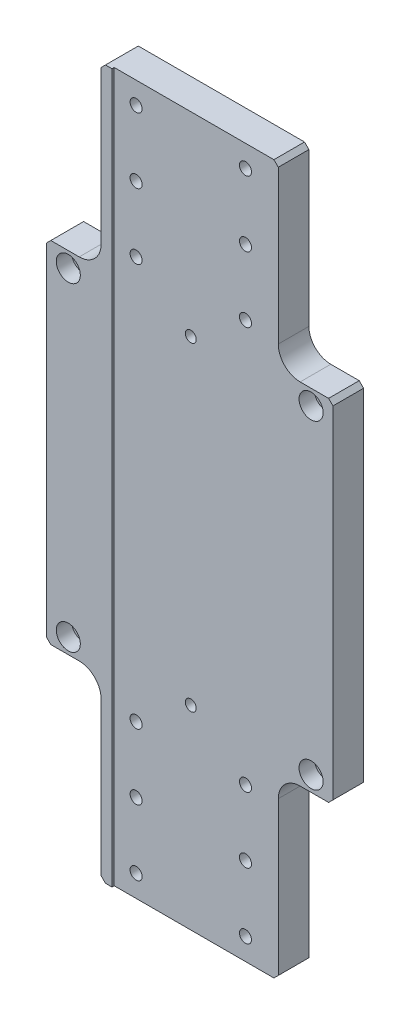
ISO-10303-21;
HEADER;
FILE_DESCRIPTION(('STEP AP214'),'2;1');
FILE_NAME('part.step','',(''),(''),'','','');
FILE_SCHEMA(('AUTOMOTIVE_DESIGN { 1 0 10303 214 1 1 1 1 }'));
ENDSEC;
DATA;
#1=APPLICATION_CONTEXT('core data for automotive mechanical design processes');
#2=APPLICATION_PROTOCOL_DEFINITION('international standard','automotive_design',2000,#1);
#3=PRODUCT_CONTEXT('',#1,'mechanical');
#4=PRODUCT('Part','Part','',(#3));
#5=PRODUCT_RELATED_PRODUCT_CATEGORY('part','',(#4));
#6=PRODUCT_DEFINITION_FORMATION('','',#4);
#7=PRODUCT_DEFINITION_CONTEXT('part definition',#1,'design');
#8=PRODUCT_DEFINITION('design','',#6,#7);
#9=PRODUCT_DEFINITION_SHAPE('','',#8);
#10=(LENGTH_UNIT() NAMED_UNIT(*) SI_UNIT(.MILLI.,.METRE.));
#11=(NAMED_UNIT(*) PLANE_ANGLE_UNIT() SI_UNIT($,.RADIAN.));
#12=(NAMED_UNIT(*) SI_UNIT($,.STERADIAN.) SOLID_ANGLE_UNIT());
#13=UNCERTAINTY_MEASURE_WITH_UNIT(LENGTH_MEASURE(1.E-05),#10,'distance_accuracy_value','');
#14=(GEOMETRIC_REPRESENTATION_CONTEXT(3) GLOBAL_UNCERTAINTY_ASSIGNED_CONTEXT((#13)) GLOBAL_UNIT_ASSIGNED_CONTEXT((#10,
#11,#12)) REPRESENTATION_CONTEXT('',''));
#15=CARTESIAN_POINT('',(0.,0.,0.));
#16=DIRECTION('',(0.,0.,1.));
#17=DIRECTION('',(1.,0.,0.));
#18=AXIS2_PLACEMENT_3D('',#15,#16,#17);
#19=CARTESIAN_POINT('',(40.,-80.,7.5));
#20=DIRECTION('',(-1.,0.,0.));
#21=DIRECTION('',(0.,-1.,0.));
#22=AXIS2_PLACEMENT_3D('',#19,#20,#21);
#23=PLANE('',#22);
#24=DIRECTION('',(0.,1.,0.));
#25=VECTOR('',#24,1.);
#26=CARTESIAN_POINT('',(40.,-80.,6.5));
#27=LINE('',#26,#25);
#28=CARTESIAN_POINT('',(40.,-160.,6.5));
#29=VERTEX_POINT('',#28);
#30=CARTESIAN_POINT('',(40.,-90.,6.5));
#31=VERTEX_POINT('',#30);
#32=EDGE_CURVE('E249',#29,#31,#27,.T.);
#33=ORIENTED_EDGE('',*,*,#32,.F.);
#34=DIRECTION('',(0.,0.,-1.));
#35=VECTOR('',#34,1.);
#36=CARTESIAN_POINT('',(40.,-160.,7.5));
#37=LINE('',#36,#35);
#38=CARTESIAN_POINT('',(40.,-160.,-7.5));
#39=VERTEX_POINT('',#38);
#40=EDGE_CURVE('E11',#29,#39,#37,.T.);
#41=ORIENTED_EDGE('',*,*,#40,.T.);
#42=DIRECTION('',(0.,1.,0.));
#43=VECTOR('',#42,1.);
#44=CARTESIAN_POINT('',(40.,-80.,-7.5));
#45=LINE('',#44,#43);
#46=CARTESIAN_POINT('',(40.,-90.,-7.5));
#47=VERTEX_POINT('',#46);
#48=EDGE_CURVE('E251',#39,#47,#45,.T.);
#49=ORIENTED_EDGE('',*,*,#48,.T.);
#50=DIRECTION('',(0.,0.,-1.));
#51=VECTOR('',#50,1.);
#52=CARTESIAN_POINT('',(40.,-90.,6.5));
#53=LINE('',#52,#51);
#54=EDGE_CURVE('E330',#47,#31,#53,.F.);
#55=ORIENTED_EDGE('',*,*,#54,.T.);
#56=EDGE_LOOP('',(#33,#41,#49,#55));
#57=FACE_BOUND('',#56,.T.);
#58=ADVANCED_FACE('F33',(#57),#23,.F.);
#59=CARTESIAN_POINT('',(65.,-80.,7.5));
#60=DIRECTION('',(0.,1.,0.));
#61=DIRECTION('',(-1.,0.,0.));
#62=AXIS2_PLACEMENT_3D('',#59,#60,#61);
#63=PLANE('',#62);
#64=DIRECTION('',(1.,0.,0.));
#65=VECTOR('',#64,1.);
#66=CARTESIAN_POINT('',(65.,-80.,-7.5));
#67=LINE('',#66,#65);
#68=CARTESIAN_POINT('',(50.,-80.,-7.5));
#69=VERTEX_POINT('',#68);
#70=CARTESIAN_POINT('',(63.0000000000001,-80.,-7.5));
#71=VERTEX_POINT('',#70);
#72=EDGE_CURVE('E273',#69,#71,#67,.T.);
#73=ORIENTED_EDGE('',*,*,#72,.T.);
#74=DIRECTION('',(0.,0.,1.));
#75=VECTOR('',#74,1.);
#76=CARTESIAN_POINT('',(63.0000000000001,-80.,7.5));
#77=LINE('',#76,#75);
#78=CARTESIAN_POINT('',(63.0000000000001,-80.,6.5));
#79=VERTEX_POINT('',#78);
#80=EDGE_CURVE('E41',#71,#79,#77,.T.);
#81=ORIENTED_EDGE('',*,*,#80,.T.);
#82=DIRECTION('',(1.,0.,0.));
#83=VECTOR('',#82,1.);
#84=CARTESIAN_POINT('',(65.,-80.,6.5));
#85=LINE('',#84,#83);
#86=CARTESIAN_POINT('',(50.,-80.,6.5));
#87=VERTEX_POINT('',#86);
#88=EDGE_CURVE('E246',#87,#79,#85,.T.);
#89=ORIENTED_EDGE('',*,*,#88,.F.);
#90=DIRECTION('',(0.,0.,-1.));
#91=VECTOR('',#90,1.);
#92=CARTESIAN_POINT('',(50.,-80.,-7.5));
#93=LINE('',#92,#91);
#94=EDGE_CURVE('E271',#87,#69,#93,.T.);
#95=ORIENTED_EDGE('',*,*,#94,.T.);
#96=EDGE_LOOP('',(#73,#81,#89,#95));
#97=FACE_BOUND('',#96,.T.);
#98=ADVANCED_FACE('F437',(#97),#63,.F.);
#99=CARTESIAN_POINT('',(65.,80.,7.5));
#100=DIRECTION('',(-1.,0.,0.));
#101=DIRECTION('',(0.,0.,1.));
#102=AXIS2_PLACEMENT_3D('',#99,#100,#101);
#103=PLANE('',#102);
#104=DIRECTION('',(0.,1.,0.));
#105=VECTOR('',#104,1.);
#106=CARTESIAN_POINT('',(65.,80.,-7.5));
#107=LINE('',#106,#105);
#108=CARTESIAN_POINT('',(65.,-78.,-7.5));
#109=VERTEX_POINT('',#108);
#110=CARTESIAN_POINT('',(65.,78.,-7.5));
#111=VERTEX_POINT('',#110);
#112=EDGE_CURVE('E276',#109,#111,#107,.T.);
#113=ORIENTED_EDGE('',*,*,#112,.T.);
#114=DIRECTION('',(0.,0.,1.));
#115=VECTOR('',#114,1.);
#116=CARTESIAN_POINT('',(65.,78.,7.5));
#117=LINE('',#116,#115);
#118=CARTESIAN_POINT('',(65.,78.,6.5));
#119=VERTEX_POINT('',#118);
#120=EDGE_CURVE('E56',#111,#119,#117,.T.);
#121=ORIENTED_EDGE('',*,*,#120,.T.);
#122=DIRECTION('',(0.,1.,0.));
#123=VECTOR('',#122,1.);
#124=CARTESIAN_POINT('',(65.,162.,6.5));
#125=LINE('',#124,#123);
#126=CARTESIAN_POINT('',(65.,-78.,6.5));
#127=VERTEX_POINT('',#126);
#128=EDGE_CURVE('E233',#127,#119,#125,.T.);
#129=ORIENTED_EDGE('',*,*,#128,.F.);
#130=DIRECTION('',(0.,0.,-1.));
#131=VECTOR('',#130,1.);
#132=CARTESIAN_POINT('',(65.,-78.,7.5));
#133=LINE('',#132,#131);
#134=EDGE_CURVE('E431',#127,#109,#133,.T.);
#135=ORIENTED_EDGE('',*,*,#134,.T.);
#136=EDGE_LOOP('',(#113,#121,#129,#135));
#137=FACE_BOUND('',#136,.T.);
#138=ADVANCED_FACE('F446',(#137),#103,.F.);
#139=CARTESIAN_POINT('',(40.,80.,7.5));
#140=DIRECTION('',(0.,-1.,0.));
#141=DIRECTION('',(0.,0.,-1.));
#142=AXIS2_PLACEMENT_3D('',#139,#140,#141);
#143=PLANE('',#142);
#144=DIRECTION('',(-1.,0.,0.));
#145=VECTOR('',#144,1.);
#146=CARTESIAN_POINT('',(40.,80.,6.5));
#147=LINE('',#146,#145);
#148=CARTESIAN_POINT('',(63.,80.,6.5));
#149=VERTEX_POINT('',#148);
#150=CARTESIAN_POINT('',(50.,80.,6.5));
#151=VERTEX_POINT('',#150);
#152=EDGE_CURVE('E244',#149,#151,#147,.T.);
#153=ORIENTED_EDGE('',*,*,#152,.F.);
#154=DIRECTION('',(0.,0.,-1.));
#155=VECTOR('',#154,1.);
#156=CARTESIAN_POINT('',(63.,80.,7.5));
#157=LINE('',#156,#155);
#158=CARTESIAN_POINT('',(63.,80.,-7.5));
#159=VERTEX_POINT('',#158);
#160=EDGE_CURVE('E428',#149,#159,#157,.T.);
#161=ORIENTED_EDGE('',*,*,#160,.T.);
#162=DIRECTION('',(-1.,0.,0.));
#163=VECTOR('',#162,1.);
#164=CARTESIAN_POINT('',(40.,80.,-7.5));
#165=LINE('',#164,#163);
#166=CARTESIAN_POINT('',(50.,80.,-7.5));
#167=VERTEX_POINT('',#166);
#168=EDGE_CURVE('E278',#159,#167,#165,.T.);
#169=ORIENTED_EDGE('',*,*,#168,.T.);
#170=DIRECTION('',(0.,0.,-1.));
#171=VECTOR('',#170,1.);
#172=CARTESIAN_POINT('',(50.,80.,6.5));
#173=LINE('',#172,#171);
#174=EDGE_CURVE('E348',#167,#151,#173,.F.);
#175=ORIENTED_EDGE('',*,*,#174,.T.);
#176=EDGE_LOOP('',(#153,#161,#169,#175));
#177=FACE_BOUND('',#176,.T.);
#178=ADVANCED_FACE('F455',(#177),#143,.F.);
#179=CARTESIAN_POINT('',(40.,162.,7.5));
#180=DIRECTION('',(-1.,0.,0.));
#181=DIRECTION('',(0.,-1.,0.));
#182=AXIS2_PLACEMENT_3D('',#179,#180,#181);
#183=PLANE('',#182);
#184=DIRECTION('',(0.,1.,0.));
#185=VECTOR('',#184,1.);
#186=CARTESIAN_POINT('',(40.,162.,-7.5));
#187=LINE('',#186,#185);
#188=CARTESIAN_POINT('',(40.,90.,-7.5));
#189=VERTEX_POINT('',#188);
#190=CARTESIAN_POINT('',(40.,160.,-7.5));
#191=VERTEX_POINT('',#190);
#192=EDGE_CURVE('E280',#189,#191,#187,.T.);
#193=ORIENTED_EDGE('',*,*,#192,.T.);
#194=DIRECTION('',(0.,0.,1.));
#195=VECTOR('',#194,1.);
#196=CARTESIAN_POINT('',(40.,160.,7.5));
#197=LINE('',#196,#195);
#198=CARTESIAN_POINT('',(40.,160.,6.5));
#199=VERTEX_POINT('',#198);
#200=EDGE_CURVE('E419',#191,#199,#197,.T.);
#201=ORIENTED_EDGE('',*,*,#200,.T.);
#202=DIRECTION('',(0.,1.,0.));
#203=VECTOR('',#202,1.);
#204=CARTESIAN_POINT('',(40.,162.,6.5));
#205=LINE('',#204,#203);
#206=CARTESIAN_POINT('',(40.,90.,6.5));
#207=VERTEX_POINT('',#206);
#208=EDGE_CURVE('E241',#207,#199,#205,.T.);
#209=ORIENTED_EDGE('',*,*,#208,.F.);
#210=DIRECTION('',(0.,0.,-1.));
#211=VECTOR('',#210,1.);
#212=CARTESIAN_POINT('',(40.,90.,-7.5));
#213=LINE('',#212,#211);
#214=EDGE_CURVE('E345',#207,#189,#213,.T.);
#215=ORIENTED_EDGE('',*,*,#214,.T.);
#216=EDGE_LOOP('',(#193,#201,#209,#215));
#217=FACE_BOUND('',#216,.T.);
#218=ADVANCED_FACE('F463',(#217),#183,.F.);
#219=CARTESIAN_POINT('',(-40.,162.,7.5));
#220=DIRECTION('',(0.,-1.,0.));
#221=DIRECTION('',(0.,0.,-1.));
#222=AXIS2_PLACEMENT_3D('',#219,#220,#221);
#223=PLANE('',#222);
#224=DIRECTION('',(-1.,0.,0.));
#225=VECTOR('',#224,1.);
#226=CARTESIAN_POINT('',(-40.,162.,-7.5));
#227=LINE('',#226,#225);
#228=CARTESIAN_POINT('',(38.,162.,-7.5));
#229=VERTEX_POINT('',#228);
#230=CARTESIAN_POINT('',(-38.,162.,-7.5));
#231=VERTEX_POINT('',#230);
#232=EDGE_CURVE('E283',#229,#231,#227,.T.);
#233=ORIENTED_EDGE('',*,*,#232,.T.);
#234=DIRECTION('',(0.,0.,1.));
#235=VECTOR('',#234,1.);
#236=CARTESIAN_POINT('',(-38.,162.,7.5));
#237=LINE('',#236,#235);
#238=CARTESIAN_POINT('',(-38.,162.,7.5));
#239=VERTEX_POINT('',#238);
#240=EDGE_CURVE('E417',#231,#239,#237,.T.);
#241=ORIENTED_EDGE('',*,*,#240,.T.);
#242=DIRECTION('',(-1.,0.,0.));
#243=VECTOR('',#242,1.);
#244=CARTESIAN_POINT('',(-40.,162.,7.5));
#245=LINE('',#244,#243);
#246=CARTESIAN_POINT('',(-35.,162.,7.5));
#247=VERTEX_POINT('',#246);
#248=EDGE_CURVE('E252',#247,#239,#245,.T.);
#249=ORIENTED_EDGE('',*,*,#248,.F.);
#250=DIRECTION('',(0.,0.,1.));
#251=VECTOR('',#250,1.);
#252=CARTESIAN_POINT('',(-35.,162.,6.5));
#253=LINE('',#252,#251);
#254=CARTESIAN_POINT('',(-35.,162.,6.5));
#255=VERTEX_POINT('',#254);
#256=EDGE_CURVE('E219',#255,#247,#253,.T.);
#257=ORIENTED_EDGE('',*,*,#256,.F.);
#258=DIRECTION('',(-1.,0.,0.));
#259=VECTOR('',#258,1.);
#260=CARTESIAN_POINT('',(-35.,162.,6.5));
#261=LINE('',#260,#259);
#262=CARTESIAN_POINT('',(38.,162.,6.5));
#263=VERTEX_POINT('',#262);
#264=EDGE_CURVE('E220',#263,#255,#261,.T.);
#265=ORIENTED_EDGE('',*,*,#264,.F.);
#266=DIRECTION('',(0.,0.,-1.));
#267=VECTOR('',#266,1.);
#268=CARTESIAN_POINT('',(38.,162.,7.5));
#269=LINE('',#268,#267);
#270=EDGE_CURVE('E414',#263,#229,#269,.T.);
#271=ORIENTED_EDGE('',*,*,#270,.T.);
#272=EDGE_LOOP('',(#233,#241,#249,#257,#265,#271));
#273=FACE_BOUND('',#272,.T.);
#274=ADVANCED_FACE('F472',(#273),#223,.F.);
#275=CARTESIAN_POINT('',(-40.,162.,7.5));
#276=DIRECTION('',(1.,0.,0.));
#277=DIRECTION('',(0.,1.,0.));
#278=AXIS2_PLACEMENT_3D('',#275,#276,#277);
#279=PLANE('',#278);
#280=DIRECTION('',(0.,-1.,0.));
#281=VECTOR('',#280,1.);
#282=CARTESIAN_POINT('',(-40.,162.,7.5));
#283=LINE('',#282,#281);
#284=CARTESIAN_POINT('',(-40.,160.,7.5));
#285=VERTEX_POINT('',#284);
#286=CARTESIAN_POINT('',(-40.,90.,7.5));
#287=VERTEX_POINT('',#286);
#288=EDGE_CURVE('E255',#285,#287,#283,.T.);
#289=ORIENTED_EDGE('',*,*,#288,.F.);
#290=DIRECTION('',(0.,0.,-1.));
#291=VECTOR('',#290,1.);
#292=CARTESIAN_POINT('',(-40.,160.,7.5));
#293=LINE('',#292,#291);
#294=CARTESIAN_POINT('',(-40.,160.,-7.5));
#295=VERTEX_POINT('',#294);
#296=EDGE_CURVE('E411',#285,#295,#293,.T.);
#297=ORIENTED_EDGE('',*,*,#296,.T.);
#298=DIRECTION('',(0.,-1.,0.));
#299=VECTOR('',#298,1.);
#300=CARTESIAN_POINT('',(-40.,162.,-7.5));
#301=LINE('',#300,#299);
#302=CARTESIAN_POINT('',(-40.,90.,-7.5));
#303=VERTEX_POINT('',#302);
#304=EDGE_CURVE('E286',#295,#303,#301,.T.);
#305=ORIENTED_EDGE('',*,*,#304,.T.);
#306=DIRECTION('',(0.,0.,-1.));
#307=VECTOR('',#306,1.);
#308=CARTESIAN_POINT('',(-40.,90.,7.5));
#309=LINE('',#308,#307);
#310=EDGE_CURVE('E342',#303,#287,#309,.F.);
#311=ORIENTED_EDGE('',*,*,#310,.T.);
#312=EDGE_LOOP('',(#289,#297,#305,#311));
#313=FACE_BOUND('',#312,.T.);
#314=ADVANCED_FACE('F521',(#313),#279,.F.);
#315=CARTESIAN_POINT('',(-40.,80.,7.5));
#316=DIRECTION('',(0.,-1.,0.));
#317=DIRECTION('',(0.,0.,-1.));
#318=AXIS2_PLACEMENT_3D('',#315,#316,#317);
#319=PLANE('',#318);
#320=DIRECTION('',(-1.,0.,0.));
#321=VECTOR('',#320,1.);
#322=CARTESIAN_POINT('',(-40.,80.,-7.5));
#323=LINE('',#322,#321);
#324=CARTESIAN_POINT('',(-50.,80.,-7.5));
#325=VERTEX_POINT('',#324);
#326=CARTESIAN_POINT('',(-63.,80.,-7.5));
#327=VERTEX_POINT('',#326);
#328=EDGE_CURVE('E288',#325,#327,#323,.T.);
#329=ORIENTED_EDGE('',*,*,#328,.T.);
#330=DIRECTION('',(0.,0.,1.));
#331=VECTOR('',#330,1.);
#332=CARTESIAN_POINT('',(-63.,80.,7.5));
#333=LINE('',#332,#331);
#334=CARTESIAN_POINT('',(-63.,80.,7.5));
#335=VERTEX_POINT('',#334);
#336=EDGE_CURVE('E409',#327,#335,#333,.T.);
#337=ORIENTED_EDGE('',*,*,#336,.T.);
#338=DIRECTION('',(-1.,0.,0.));
#339=VECTOR('',#338,1.);
#340=CARTESIAN_POINT('',(-40.,80.,7.5));
#341=LINE('',#340,#339);
#342=CARTESIAN_POINT('',(-50.,80.,7.5));
#343=VERTEX_POINT('',#342);
#344=EDGE_CURVE('E258',#343,#335,#341,.T.);
#345=ORIENTED_EDGE('',*,*,#344,.F.);
#346=DIRECTION('',(0.,0.,-1.));
#347=VECTOR('',#346,1.);
#348=CARTESIAN_POINT('',(-50.,80.,-7.5));
#349=LINE('',#348,#347);
#350=EDGE_CURVE('E339',#343,#325,#349,.T.);
#351=ORIENTED_EDGE('',*,*,#350,.T.);
#352=EDGE_LOOP('',(#329,#337,#345,#351));
#353=FACE_BOUND('',#352,.T.);
#354=ADVANCED_FACE('F512',(#353),#319,.F.);
#355=CARTESIAN_POINT('',(-65.,80.,7.5));
#356=DIRECTION('',(1.,0.,0.));
#357=DIRECTION('',(0.,1.,0.));
#358=AXIS2_PLACEMENT_3D('',#355,#356,#357);
#359=PLANE('',#358);
#360=DIRECTION('',(0.,-1.,0.));
#361=VECTOR('',#360,1.);
#362=CARTESIAN_POINT('',(-65.,80.,-7.5));
#363=LINE('',#362,#361);
#364=CARTESIAN_POINT('',(-65.,78.0000000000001,-7.5));
#365=VERTEX_POINT('',#364);
#366=CARTESIAN_POINT('',(-65.,-78.,-7.5));
#367=VERTEX_POINT('',#366);
#368=EDGE_CURVE('E291',#365,#367,#363,.T.);
#369=ORIENTED_EDGE('',*,*,#368,.T.);
#370=DIRECTION('',(0.,0.,1.));
#371=VECTOR('',#370,1.);
#372=CARTESIAN_POINT('',(-65.,-78.,7.5));
#373=LINE('',#372,#371);
#374=CARTESIAN_POINT('',(-65.,-78.,7.5));
#375=VERTEX_POINT('',#374);
#376=EDGE_CURVE('E407',#367,#375,#373,.T.);
#377=ORIENTED_EDGE('',*,*,#376,.T.);
#378=DIRECTION('',(0.,-1.,0.));
#379=VECTOR('',#378,1.);
#380=CARTESIAN_POINT('',(-65.,80.,7.5));
#381=LINE('',#380,#379);
#382=CARTESIAN_POINT('',(-65.,78.0000000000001,7.5));
#383=VERTEX_POINT('',#382);
#384=EDGE_CURVE('E261',#383,#375,#381,.T.);
#385=ORIENTED_EDGE('',*,*,#384,.F.);
#386=DIRECTION('',(0.,0.,-1.));
#387=VECTOR('',#386,1.);
#388=CARTESIAN_POINT('',(-65.,78.0000000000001,7.5));
#389=LINE('',#388,#387);
#390=EDGE_CURVE('E404',#383,#365,#389,.T.);
#391=ORIENTED_EDGE('',*,*,#390,.T.);
#392=EDGE_LOOP('',(#369,#377,#385,#391));
#393=FACE_BOUND('',#392,.T.);
#394=ADVANCED_FACE('F503',(#393),#359,.F.);
#395=CARTESIAN_POINT('',(-65.,-80.,7.5));
#396=DIRECTION('',(0.,1.,0.));
#397=DIRECTION('',(-1.,0.,0.));
#398=AXIS2_PLACEMENT_3D('',#395,#396,#397);
#399=PLANE('',#398);
#400=DIRECTION('',(1.,0.,0.));
#401=VECTOR('',#400,1.);
#402=CARTESIAN_POINT('',(-65.,-80.,7.5));
#403=LINE('',#402,#401);
#404=CARTESIAN_POINT('',(-62.9999999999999,-80.,7.5));
#405=VERTEX_POINT('',#404);
#406=CARTESIAN_POINT('',(-50.,-80.,7.5));
#407=VERTEX_POINT('',#406);
#408=EDGE_CURVE('E264',#405,#407,#403,.T.);
#409=ORIENTED_EDGE('',*,*,#408,.F.);
#410=DIRECTION('',(0.,0.,-1.));
#411=VECTOR('',#410,1.);
#412=CARTESIAN_POINT('',(-62.9999999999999,-80.,7.5));
#413=LINE('',#412,#411);
#414=CARTESIAN_POINT('',(-62.9999999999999,-80.,-7.5));
#415=VERTEX_POINT('',#414);
#416=EDGE_CURVE('E401',#405,#415,#413,.T.);
#417=ORIENTED_EDGE('',*,*,#416,.T.);
#418=DIRECTION('',(1.,0.,0.));
#419=VECTOR('',#418,1.);
#420=CARTESIAN_POINT('',(-65.,-80.,-7.5));
#421=LINE('',#420,#419);
#422=CARTESIAN_POINT('',(-50.,-80.,-7.5));
#423=VERTEX_POINT('',#422);
#424=EDGE_CURVE('E294',#415,#423,#421,.T.);
#425=ORIENTED_EDGE('',*,*,#424,.T.);
#426=DIRECTION('',(0.,0.,-1.));
#427=VECTOR('',#426,1.);
#428=CARTESIAN_POINT('',(-50.,-80.,7.5));
#429=LINE('',#428,#427);
#430=EDGE_CURVE('E336',#423,#407,#429,.F.);
#431=ORIENTED_EDGE('',*,*,#430,.T.);
#432=EDGE_LOOP('',(#409,#417,#425,#431));
#433=FACE_BOUND('',#432,.T.);
#434=ADVANCED_FACE('F495',(#433),#399,.F.);
#435=CARTESIAN_POINT('',(-40.,-80.,7.5));
#436=DIRECTION('',(1.,0.,0.));
#437=DIRECTION('',(0.,1.,0.));
#438=AXIS2_PLACEMENT_3D('',#435,#436,#437);
#439=PLANE('',#438);
#440=DIRECTION('',(0.,-1.,0.));
#441=VECTOR('',#440,1.);
#442=CARTESIAN_POINT('',(-40.,-80.,-7.5));
#443=LINE('',#442,#441);
#444=CARTESIAN_POINT('',(-40.,-90.,-7.5));
#445=VERTEX_POINT('',#444);
#446=CARTESIAN_POINT('',(-40.,-160.,-7.5));
#447=VERTEX_POINT('',#446);
#448=EDGE_CURVE('E296',#445,#447,#443,.T.);
#449=ORIENTED_EDGE('',*,*,#448,.T.);
#450=DIRECTION('',(0.,0.,1.));
#451=VECTOR('',#450,1.);
#452=CARTESIAN_POINT('',(-40.,-160.,7.5));
#453=LINE('',#452,#451);
#454=CARTESIAN_POINT('',(-40.,-160.,7.5));
#455=VERTEX_POINT('',#454);
#456=EDGE_CURVE('E391',#447,#455,#453,.T.);
#457=ORIENTED_EDGE('',*,*,#456,.T.);
#458=DIRECTION('',(0.,-1.,0.));
#459=VECTOR('',#458,1.);
#460=CARTESIAN_POINT('',(-40.,-80.,7.5));
#461=LINE('',#460,#459);
#462=CARTESIAN_POINT('',(-40.,-90.,7.5));
#463=VERTEX_POINT('',#462);
#464=EDGE_CURVE('E266',#463,#455,#461,.T.);
#465=ORIENTED_EDGE('',*,*,#464,.F.);
#466=DIRECTION('',(0.,0.,-1.));
#467=VECTOR('',#466,1.);
#468=CARTESIAN_POINT('',(-40.,-90.,-7.5));
#469=LINE('',#468,#467);
#470=EDGE_CURVE('E333',#463,#445,#469,.T.);
#471=ORIENTED_EDGE('',*,*,#470,.T.);
#472=EDGE_LOOP('',(#449,#457,#465,#471));
#473=FACE_BOUND('',#472,.T.);
#474=ADVANCED_FACE('F484',(#473),#439,.F.);
#475=CARTESIAN_POINT('',(-40.,-162.,7.5));
#476=DIRECTION('',(0.,1.,0.));
#477=DIRECTION('',(0.,0.,1.));
#478=AXIS2_PLACEMENT_3D('',#475,#476,#477);
#479=PLANE('',#478);
#480=DIRECTION('',(1.,0.,0.));
#481=VECTOR('',#480,1.);
#482=CARTESIAN_POINT('',(-40.,-162.,7.5));
#483=LINE('',#482,#481);
#484=CARTESIAN_POINT('',(-38.,-162.,7.5));
#485=VERTEX_POINT('',#484);
#486=CARTESIAN_POINT('',(-35.,-162.,7.5));
#487=VERTEX_POINT('',#486);
#488=EDGE_CURVE('E269',#485,#487,#483,.T.);
#489=ORIENTED_EDGE('',*,*,#488,.F.);
#490=DIRECTION('',(0.,0.,-1.));
#491=VECTOR('',#490,1.);
#492=CARTESIAN_POINT('',(-38.,-162.,7.5));
#493=LINE('',#492,#491);
#494=CARTESIAN_POINT('',(-38.,-162.,-7.5));
#495=VERTEX_POINT('',#494);
#496=EDGE_CURVE('E372',#485,#495,#493,.T.);
#497=ORIENTED_EDGE('',*,*,#496,.T.);
#498=DIRECTION('',(1.,0.,0.));
#499=VECTOR('',#498,1.);
#500=CARTESIAN_POINT('',(-40.,-162.,-7.5));
#501=LINE('',#500,#499);
#502=CARTESIAN_POINT('',(38.,-162.,-7.5));
#503=VERTEX_POINT('',#502);
#504=EDGE_CURVE('E256',#495,#503,#501,.T.);
#505=ORIENTED_EDGE('',*,*,#504,.T.);
#506=DIRECTION('',(0.,0.,1.));
#507=VECTOR('',#506,1.);
#508=CARTESIAN_POINT('',(38.,-162.,7.5));
#509=LINE('',#508,#507);
#510=CARTESIAN_POINT('',(38.,-162.,6.5));
#511=VERTEX_POINT('',#510);
#512=EDGE_CURVE('E232',#503,#511,#509,.T.);
#513=ORIENTED_EDGE('',*,*,#512,.T.);
#514=DIRECTION('',(1.,0.,0.));
#515=VECTOR('',#514,1.);
#516=CARTESIAN_POINT('',(-35.,-162.,6.5));
#517=LINE('',#516,#515);
#518=CARTESIAN_POINT('',(-35.,-162.,6.5));
#519=VERTEX_POINT('',#518);
#520=EDGE_CURVE('E225',#519,#511,#517,.T.);
#521=ORIENTED_EDGE('',*,*,#520,.F.);
#522=DIRECTION('',(0.,0.,1.));
#523=VECTOR('',#522,1.);
#524=CARTESIAN_POINT('',(-35.,-162.,6.5));
#525=LINE('',#524,#523);
#526=EDGE_CURVE('E209',#519,#487,#525,.T.);
#527=ORIENTED_EDGE('',*,*,#526,.T.);
#528=EDGE_LOOP('',(#489,#497,#505,#513,#521,#527));
#529=FACE_BOUND('',#528,.T.);
#530=ADVANCED_FACE('F229',(#529),#479,.F.);
#531=CARTESIAN_POINT('',(0.,0.,7.5));
#532=DIRECTION('',(0.,0.,1.));
#533=DIRECTION('',(1.,0.,0.));
#534=AXIS2_PLACEMENT_3D('',#531,#532,#533);
#535=PLANE('',#534);
#536=CARTESIAN_POINT('',(-55.,73.,7.5));
#537=DIRECTION('',(0.,0.,1.));
#538=DIRECTION('',(1.,0.,0.));
#539=AXIS2_PLACEMENT_3D('',#536,#537,#538);
#540=CIRCLE('',#539,5.5);
#541=CARTESIAN_POINT('',(-49.5,73.,7.5));
#542=VERTEX_POINT('',#541);
#543=EDGE_CURVE('E1262',#542,#542,#540,.T.);
#544=ORIENTED_EDGE('',*,*,#543,.F.);
#545=EDGE_LOOP('',(#544));
#546=FACE_BOUND('',#545,.T.);
#547=CARTESIAN_POINT('',(-55.,-73.,7.5));
#548=DIRECTION('',(0.,0.,1.));
#549=DIRECTION('',(1.,0.,0.));
#550=AXIS2_PLACEMENT_3D('',#547,#548,#549);
#551=CIRCLE('',#550,5.5);
#552=CARTESIAN_POINT('',(-49.5,-73.,7.5));
#553=VERTEX_POINT('',#552);
#554=EDGE_CURVE('E1265',#553,#553,#551,.T.);
#555=ORIENTED_EDGE('',*,*,#554,.F.);
#556=EDGE_LOOP('',(#555));
#557=FACE_BOUND('',#556,.T.);
#558=ORIENTED_EDGE('',*,*,#464,.T.);
#559=DIRECTION('',(-0.707106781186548,0.707106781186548,0.));
#560=VECTOR('',#559,1.);
#561=CARTESIAN_POINT('',(-100.,-100.,7.5));
#562=LINE('',#561,#560);
#563=EDGE_CURVE('E399',#455,#485,#562,.F.);
#564=ORIENTED_EDGE('',*,*,#563,.T.);
#565=ORIENTED_EDGE('',*,*,#488,.T.);
#566=DIRECTION('',(0.,-1.,0.));
#567=VECTOR('',#566,1.);
#568=CARTESIAN_POINT('',(-35.,162.,7.5));
#569=LINE('',#568,#567);
#570=EDGE_CURVE('E215',#247,#487,#569,.T.);
#571=ORIENTED_EDGE('',*,*,#570,.F.);
#572=ORIENTED_EDGE('',*,*,#248,.T.);
#573=DIRECTION('',(0.707106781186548,0.707106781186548,0.));
#574=VECTOR('',#573,1.);
#575=CARTESIAN_POINT('',(-100.,100.,7.5));
#576=LINE('',#575,#574);
#577=EDGE_CURVE('E393',#239,#285,#576,.F.);
#578=ORIENTED_EDGE('',*,*,#577,.T.);
#579=ORIENTED_EDGE('',*,*,#288,.T.);
#580=CARTESIAN_POINT('',(-50.,90.,7.5));
#581=DIRECTION('',(0.,0.,1.));
#582=DIRECTION('',(1.,0.,0.));
#583=AXIS2_PLACEMENT_3D('',#580,#581,#582);
#584=CIRCLE('',#583,10.);
#585=EDGE_CURVE('E364',#287,#343,#584,.F.);
#586=ORIENTED_EDGE('',*,*,#585,.T.);
#587=ORIENTED_EDGE('',*,*,#344,.T.);
#588=DIRECTION('',(0.707106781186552,0.707106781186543,0.));
#589=VECTOR('',#588,1.);
#590=CARTESIAN_POINT('',(-71.4999999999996,71.5000000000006,7.5));
#591=LINE('',#590,#589);
#592=EDGE_CURVE('E395',#335,#383,#591,.F.);
#593=ORIENTED_EDGE('',*,*,#592,.T.);
#594=ORIENTED_EDGE('',*,*,#384,.T.);
#595=DIRECTION('',(-0.707106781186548,0.707106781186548,0.));
#596=VECTOR('',#595,1.);
#597=CARTESIAN_POINT('',(-71.5,-71.5,7.5));
#598=LINE('',#597,#596);
#599=EDGE_CURVE('E397',#375,#405,#598,.F.);
#600=ORIENTED_EDGE('',*,*,#599,.T.);
#601=ORIENTED_EDGE('',*,*,#408,.T.);
#602=CARTESIAN_POINT('',(-50.,-90.,7.5));
#603=DIRECTION('',(0.,0.,1.));
#604=DIRECTION('',(1.,0.,0.));
#605=AXIS2_PLACEMENT_3D('',#602,#603,#604);
#606=CIRCLE('',#605,10.);
#607=EDGE_CURVE('E359',#407,#463,#606,.F.);
#608=ORIENTED_EDGE('',*,*,#607,.T.);
#609=EDGE_LOOP('',(#558,#564,#565,#571,#572,#578,#579,#586,#587,#593,#594,#600,#601,#608));
#610=FACE_BOUND('',#609,.T.);
#611=ADVANCED_FACE('F475',(#546,#557,#610),#535,.T.);
#612=CARTESIAN_POINT('',(0.,0.,-7.5));
#613=DIRECTION('',(0.,0.,1.));
#614=DIRECTION('',(1.,0.,0.));
#615=AXIS2_PLACEMENT_3D('',#612,#613,#614);
#616=PLANE('',#615);
#617=CARTESIAN_POINT('',(0.,73.,-7.5));
#618=DIRECTION('',(0.,0.,1.));
#619=DIRECTION('',(1.,0.,0.));
#620=AXIS2_PLACEMENT_3D('',#617,#618,#619);
#621=CIRCLE('',#620,2.5);
#622=CARTESIAN_POINT('',(2.5,73.,-7.5));
#623=VERTEX_POINT('',#622);
#624=EDGE_CURVE('E1546',#623,#623,#621,.T.);
#625=ORIENTED_EDGE('',*,*,#624,.T.);
#626=EDGE_LOOP('',(#625));
#627=FACE_BOUND('',#626,.T.);
#628=CARTESIAN_POINT('',(0.,-73.,-7.5));
#629=DIRECTION('',(0.,0.,1.));
#630=DIRECTION('',(1.,0.,0.));
#631=AXIS2_PLACEMENT_3D('',#628,#629,#630);
#632=CIRCLE('',#631,2.5);
#633=CARTESIAN_POINT('',(2.5,-73.,-7.5));
#634=VERTEX_POINT('',#633);
#635=EDGE_CURVE('E1540',#634,#634,#632,.T.);
#636=ORIENTED_EDGE('',*,*,#635,.T.);
#637=EDGE_LOOP('',(#636));
#638=FACE_BOUND('',#637,.T.);
#639=CARTESIAN_POINT('',(55.,73.,-7.5));
#640=DIRECTION('',(0.,0.,1.));
#641=DIRECTION('',(1.,0.,0.));
#642=AXIS2_PLACEMENT_3D('',#639,#640,#641);
#643=CIRCLE('',#642,3.3);
#644=CARTESIAN_POINT('',(58.3,73.,-7.5));
#645=VERTEX_POINT('',#644);
#646=EDGE_CURVE('E1528',#645,#645,#643,.T.);
#647=ORIENTED_EDGE('',*,*,#646,.T.);
#648=EDGE_LOOP('',(#647));
#649=FACE_BOUND('',#648,.T.);
#650=CARTESIAN_POINT('',(55.,-73.,-7.5));
#651=DIRECTION('',(0.,0.,1.));
#652=DIRECTION('',(1.,0.,0.));
#653=AXIS2_PLACEMENT_3D('',#650,#651,#652);
#654=CIRCLE('',#653,3.3);
#655=CARTESIAN_POINT('',(58.3,-73.,-7.5));
#656=VERTEX_POINT('',#655);
#657=EDGE_CURVE('E1516',#656,#656,#654,.T.);
#658=ORIENTED_EDGE('',*,*,#657,.T.);
#659=EDGE_LOOP('',(#658));
#660=FACE_BOUND('',#659,.T.);
#661=CARTESIAN_POINT('',(-55.,73.,-7.5));
#662=DIRECTION('',(0.,0.,1.));
#663=DIRECTION('',(1.,0.,0.));
#664=AXIS2_PLACEMENT_3D('',#661,#662,#663);
#665=CIRCLE('',#664,3.3);
#666=CARTESIAN_POINT('',(-51.7,73.,-7.5));
#667=VERTEX_POINT('',#666);
#668=EDGE_CURVE('E1268',#667,#667,#665,.T.);
#669=ORIENTED_EDGE('',*,*,#668,.T.);
#670=EDGE_LOOP('',(#669));
#671=FACE_BOUND('',#670,.T.);
#672=CARTESIAN_POINT('',(-55.,-73.,-7.5));
#673=DIRECTION('',(0.,0.,1.));
#674=DIRECTION('',(1.,0.,0.));
#675=AXIS2_PLACEMENT_3D('',#672,#673,#674);
#676=CIRCLE('',#675,3.3);
#677=CARTESIAN_POINT('',(-51.7,-73.,-7.5));
#678=VERTEX_POINT('',#677);
#679=EDGE_CURVE('E1280',#678,#678,#676,.T.);
#680=ORIENTED_EDGE('',*,*,#679,.T.);
#681=EDGE_LOOP('',(#680));
#682=FACE_BOUND('',#681,.T.);
#683=CARTESIAN_POINT('',(-25.,-92.,-7.5));
#684=DIRECTION('',(0.,0.,-1.));
#685=DIRECTION('',(-1.,0.,0.));
#686=AXIS2_PLACEMENT_3D('',#683,#684,#685);
#687=CIRCLE('',#686,4.75);
#688=CARTESIAN_POINT('',(-29.75,-92.,-7.5));
#689=VERTEX_POINT('',#688);
#690=EDGE_CURVE('E1283',#689,#689,#687,.T.);
#691=ORIENTED_EDGE('',*,*,#690,.F.);
#692=EDGE_LOOP('',(#691));
#693=FACE_BOUND('',#692,.T.);
#694=CARTESIAN_POINT('',(25.,-122.,-7.5));
#695=DIRECTION('',(0.,0.,-1.));
#696=DIRECTION('',(-1.,0.,0.));
#697=AXIS2_PLACEMENT_3D('',#694,#695,#696);
#698=CIRCLE('',#697,4.75);
#699=CARTESIAN_POINT('',(20.25,-122.,-7.5));
#700=VERTEX_POINT('',#699);
#701=EDGE_CURVE('E1295',#700,#700,#698,.T.);
#702=ORIENTED_EDGE('',*,*,#701,.F.);
#703=EDGE_LOOP('',(#702));
#704=FACE_BOUND('',#703,.T.);
#705=CARTESIAN_POINT('',(-25.,-122.,-7.5));
#706=DIRECTION('',(0.,0.,-1.));
#707=DIRECTION('',(-1.,0.,0.));
#708=AXIS2_PLACEMENT_3D('',#705,#706,#707);
#709=CIRCLE('',#708,4.75);
#710=CARTESIAN_POINT('',(-29.75,-122.,-7.5));
#711=VERTEX_POINT('',#710);
#712=EDGE_CURVE('E1307',#711,#711,#709,.T.);
#713=ORIENTED_EDGE('',*,*,#712,.F.);
#714=EDGE_LOOP('',(#713));
#715=FACE_BOUND('',#714,.T.);
#716=CARTESIAN_POINT('',(25.,-152.,-7.5));
#717=DIRECTION('',(0.,0.,-1.));
#718=DIRECTION('',(-1.,0.,0.));
#719=AXIS2_PLACEMENT_3D('',#716,#717,#718);
#720=CIRCLE('',#719,4.75);
#721=CARTESIAN_POINT('',(20.25,-152.,-7.5));
#722=VERTEX_POINT('',#721);
#723=EDGE_CURVE('E1319',#722,#722,#720,.T.);
#724=ORIENTED_EDGE('',*,*,#723,.F.);
#725=EDGE_LOOP('',(#724));
#726=FACE_BOUND('',#725,.T.);
#727=CARTESIAN_POINT('',(-25.,-152.,-7.5));
#728=DIRECTION('',(0.,0.,-1.));
#729=DIRECTION('',(-1.,0.,0.));
#730=AXIS2_PLACEMENT_3D('',#727,#728,#729);
#731=CIRCLE('',#730,4.75);
#732=CARTESIAN_POINT('',(-29.75,-152.,-7.5));
#733=VERTEX_POINT('',#732);
#734=EDGE_CURVE('E1331',#733,#733,#731,.T.);
#735=ORIENTED_EDGE('',*,*,#734,.F.);
#736=EDGE_LOOP('',(#735));
#737=FACE_BOUND('',#736,.T.);
#738=CARTESIAN_POINT('',(25.,-92.,-7.5));
#739=DIRECTION('',(0.,0.,-1.));
#740=DIRECTION('',(-1.,0.,0.));
#741=AXIS2_PLACEMENT_3D('',#738,#739,#740);
#742=CIRCLE('',#741,4.75);
#743=CARTESIAN_POINT('',(20.25,-92.,-7.5));
#744=VERTEX_POINT('',#743);
#745=EDGE_CURVE('E1343',#744,#744,#742,.T.);
#746=ORIENTED_EDGE('',*,*,#745,.F.);
#747=EDGE_LOOP('',(#746));
#748=FACE_BOUND('',#747,.T.);
#749=CARTESIAN_POINT('',(25.,152.,-7.5));
#750=DIRECTION('',(0.,0.,-1.));
#751=DIRECTION('',(-1.,0.,0.));
#752=AXIS2_PLACEMENT_3D('',#749,#750,#751);
#753=CIRCLE('',#752,4.75);
#754=CARTESIAN_POINT('',(20.25,152.,-7.5));
#755=VERTEX_POINT('',#754);
#756=EDGE_CURVE('E1355',#755,#755,#753,.T.);
#757=ORIENTED_EDGE('',*,*,#756,.F.);
#758=EDGE_LOOP('',(#757));
#759=FACE_BOUND('',#758,.T.);
#760=CARTESIAN_POINT('',(-25.,152.,-7.5));
#761=DIRECTION('',(0.,0.,-1.));
#762=DIRECTION('',(-1.,0.,0.));
#763=AXIS2_PLACEMENT_3D('',#760,#761,#762);
#764=CIRCLE('',#763,4.75);
#765=CARTESIAN_POINT('',(-29.75,152.,-7.5));
#766=VERTEX_POINT('',#765);
#767=EDGE_CURVE('E326',#766,#766,#764,.T.);
#768=ORIENTED_EDGE('',*,*,#767,.F.);
#769=EDGE_LOOP('',(#768));
#770=FACE_BOUND('',#769,.T.);
#771=CARTESIAN_POINT('',(25.,122.,-7.5));
#772=DIRECTION('',(0.,0.,-1.));
#773=DIRECTION('',(-1.,0.,0.));
#774=AXIS2_PLACEMENT_3D('',#771,#772,#773);
#775=CIRCLE('',#774,4.75);
#776=CARTESIAN_POINT('',(20.25,122.,-7.5));
#777=VERTEX_POINT('',#776);
#778=EDGE_CURVE('E321',#777,#777,#775,.T.);
#779=ORIENTED_EDGE('',*,*,#778,.F.);
#780=EDGE_LOOP('',(#779));
#781=FACE_BOUND('',#780,.T.);
#782=CARTESIAN_POINT('',(-25.,122.,-7.5));
#783=DIRECTION('',(0.,0.,-1.));
#784=DIRECTION('',(-1.,0.,0.));
#785=AXIS2_PLACEMENT_3D('',#782,#783,#784);
#786=CIRCLE('',#785,4.75);
#787=CARTESIAN_POINT('',(-29.75,122.,-7.5));
#788=VERTEX_POINT('',#787);
#789=EDGE_CURVE('E316',#788,#788,#786,.T.);
#790=ORIENTED_EDGE('',*,*,#789,.F.);
#791=EDGE_LOOP('',(#790));
#792=FACE_BOUND('',#791,.T.);
#793=CARTESIAN_POINT('',(25.,92.,-7.5));
#794=DIRECTION('',(0.,0.,-1.));
#795=DIRECTION('',(-1.,0.,0.));
#796=AXIS2_PLACEMENT_3D('',#793,#794,#795);
#797=CIRCLE('',#796,4.75);
#798=CARTESIAN_POINT('',(20.25,92.,-7.5));
#799=VERTEX_POINT('',#798);
#800=EDGE_CURVE('E311',#799,#799,#797,.T.);
#801=ORIENTED_EDGE('',*,*,#800,.F.);
#802=EDGE_LOOP('',(#801));
#803=FACE_BOUND('',#802,.T.);
#804=CARTESIAN_POINT('',(-25.,92.,-7.5));
#805=DIRECTION('',(0.,0.,-1.));
#806=DIRECTION('',(-1.,0.,0.));
#807=AXIS2_PLACEMENT_3D('',#804,#805,#806);
#808=CIRCLE('',#807,4.75);
#809=CARTESIAN_POINT('',(-29.75,92.,-7.5));
#810=VERTEX_POINT('',#809);
#811=EDGE_CURVE('E306',#810,#810,#808,.T.);
#812=ORIENTED_EDGE('',*,*,#811,.F.);
#813=EDGE_LOOP('',(#812));
#814=FACE_BOUND('',#813,.T.);
#815=ORIENTED_EDGE('',*,*,#504,.F.);
#816=DIRECTION('',(0.707106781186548,-0.707106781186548,0.));
#817=VECTOR('',#816,1.);
#818=CARTESIAN_POINT('',(-38.,-162.,-7.5));
#819=LINE('',#818,#817);
#820=EDGE_CURVE('E389',#495,#447,#819,.F.);
#821=ORIENTED_EDGE('',*,*,#820,.T.);
#822=ORIENTED_EDGE('',*,*,#448,.F.);
#823=CARTESIAN_POINT('',(-50.,-90.,-7.5));
#824=DIRECTION('',(0.,0.,1.));
#825=DIRECTION('',(1.,0.,0.));
#826=AXIS2_PLACEMENT_3D('',#823,#824,#825);
#827=CIRCLE('',#826,10.);
#828=EDGE_CURVE('E356',#445,#423,#827,.T.);
#829=ORIENTED_EDGE('',*,*,#828,.T.);
#830=ORIENTED_EDGE('',*,*,#424,.F.);
#831=DIRECTION('',(0.707106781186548,-0.707106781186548,0.));
#832=VECTOR('',#831,1.);
#833=CARTESIAN_POINT('',(-62.9999999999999,-80.,-7.5));
#834=LINE('',#833,#832);
#835=EDGE_CURVE('E387',#415,#367,#834,.F.);
#836=ORIENTED_EDGE('',*,*,#835,.T.);
#837=ORIENTED_EDGE('',*,*,#368,.F.);
#838=DIRECTION('',(-0.707106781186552,-0.707106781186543,0.));
#839=VECTOR('',#838,1.);
#840=CARTESIAN_POINT('',(-65.,78.0000000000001,-7.5));
#841=LINE('',#840,#839);
#842=EDGE_CURVE('E385',#365,#327,#841,.F.);
#843=ORIENTED_EDGE('',*,*,#842,.T.);
#844=ORIENTED_EDGE('',*,*,#328,.F.);
#845=CARTESIAN_POINT('',(-50.,90.,-7.5));
#846=DIRECTION('',(0.,0.,1.));
#847=DIRECTION('',(1.,0.,0.));
#848=AXIS2_PLACEMENT_3D('',#845,#846,#847);
#849=CIRCLE('',#848,10.);
#850=EDGE_CURVE('E361',#325,#303,#849,.T.);
#851=ORIENTED_EDGE('',*,*,#850,.T.);
#852=ORIENTED_EDGE('',*,*,#304,.F.);
#853=DIRECTION('',(-0.707106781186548,-0.707106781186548,0.));
#854=VECTOR('',#853,1.);
#855=CARTESIAN_POINT('',(-40.,160.,-7.5));
#856=LINE('',#855,#854);
#857=EDGE_CURVE('E383',#295,#231,#856,.F.);
#858=ORIENTED_EDGE('',*,*,#857,.T.);
#859=ORIENTED_EDGE('',*,*,#232,.F.);
#860=DIRECTION('',(-0.707106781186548,0.707106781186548,0.));
#861=VECTOR('',#860,1.);
#862=CARTESIAN_POINT('',(38.,162.,-7.5));
#863=LINE('',#862,#861);
#864=EDGE_CURVE('E381',#229,#191,#863,.F.);
#865=ORIENTED_EDGE('',*,*,#864,.T.);
#866=ORIENTED_EDGE('',*,*,#192,.F.);
#867=CARTESIAN_POINT('',(50.,90.,-7.5));
#868=DIRECTION('',(0.,0.,1.));
#869=DIRECTION('',(1.,0.,0.));
#870=AXIS2_PLACEMENT_3D('',#867,#868,#869);
#871=CIRCLE('',#870,10.);
#872=EDGE_CURVE('E366',#189,#167,#871,.T.);
#873=ORIENTED_EDGE('',*,*,#872,.T.);
#874=ORIENTED_EDGE('',*,*,#168,.F.);
#875=DIRECTION('',(-0.707106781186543,0.707106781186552,0.));
#876=VECTOR('',#875,1.);
#877=CARTESIAN_POINT('',(63.,80.,-7.5));
#878=LINE('',#877,#876);
#879=EDGE_CURVE('E379',#159,#111,#878,.F.);
#880=ORIENTED_EDGE('',*,*,#879,.T.);
#881=ORIENTED_EDGE('',*,*,#112,.F.);
#882=DIRECTION('',(0.707106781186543,0.707106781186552,0.));
#883=VECTOR('',#882,1.);
#884=CARTESIAN_POINT('',(65.,-78.,-7.5));
#885=LINE('',#884,#883);
#886=EDGE_CURVE('E377',#109,#71,#885,.F.);
#887=ORIENTED_EDGE('',*,*,#886,.T.);
#888=ORIENTED_EDGE('',*,*,#72,.F.);
#889=CARTESIAN_POINT('',(50.,-90.,-7.5));
#890=DIRECTION('',(0.,0.,1.));
#891=DIRECTION('',(1.,0.,0.));
#892=AXIS2_PLACEMENT_3D('',#889,#890,#891);
#893=CIRCLE('',#892,10.);
#894=EDGE_CURVE('E351',#69,#47,#893,.T.);
#895=ORIENTED_EDGE('',*,*,#894,.T.);
#896=ORIENTED_EDGE('',*,*,#48,.F.);
#897=DIRECTION('',(0.70710678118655,0.707106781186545,0.));
#898=VECTOR('',#897,1.);
#899=CARTESIAN_POINT('',(40.,-160.,-7.5));
#900=LINE('',#899,#898);
#901=EDGE_CURVE('E375',#39,#503,#900,.F.);
#902=ORIENTED_EDGE('',*,*,#901,.T.);
#903=EDGE_LOOP('',(#815,#821,#822,#829,#830,#836,#837,#843,#844,#851,#852,#858,#859,#865,#866,
#873,#874,#880,#881,#887,#888,#895,#896,#902));
#904=FACE_BOUND('',#903,.T.);
#905=ADVANCED_FACE('F449',(#627,#638,#649,#660,#671,#682,#693,#704,#715,#726,#737,#748,#759,
#770,#781,#792,#803,#814,#904),#616,.F.);
#906=CARTESIAN_POINT('',(0.,0.,6.5));
#907=DIRECTION('',(0.,0.,1.));
#908=DIRECTION('',(1.,0.,0.));
#909=AXIS2_PLACEMENT_3D('',#906,#907,#908);
#910=PLANE('',#909);
#911=CARTESIAN_POINT('',(0.,73.,6.5));
#912=DIRECTION('',(0.,0.,1.));
#913=DIRECTION('',(1.,0.,0.));
#914=AXIS2_PLACEMENT_3D('',#911,#912,#913);
#915=CIRCLE('',#914,2.49999999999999);
#916=CARTESIAN_POINT('',(2.49999999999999,73.,6.5));
#917=VERTEX_POINT('',#916);
#918=EDGE_CURVE('E1549',#917,#917,#915,.T.);
#919=ORIENTED_EDGE('',*,*,#918,.F.);
#920=EDGE_LOOP('',(#919));
#921=FACE_BOUND('',#920,.T.);
#922=CARTESIAN_POINT('',(0.,-73.,6.5));
#923=DIRECTION('',(0.,0.,1.));
#924=DIRECTION('',(1.,0.,0.));
#925=AXIS2_PLACEMENT_3D('',#922,#923,#924);
#926=CIRCLE('',#925,2.49999999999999);
#927=CARTESIAN_POINT('',(2.49999999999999,-73.,6.5));
#928=VERTEX_POINT('',#927);
#929=EDGE_CURVE('E1543',#928,#928,#926,.T.);
#930=ORIENTED_EDGE('',*,*,#929,.F.);
#931=EDGE_LOOP('',(#930));
#932=FACE_BOUND('',#931,.T.);
#933=CARTESIAN_POINT('',(55.,73.,6.5));
#934=DIRECTION('',(0.,0.,1.));
#935=DIRECTION('',(1.,0.,0.));
#936=AXIS2_PLACEMENT_3D('',#933,#934,#935);
#937=CIRCLE('',#936,5.5);
#938=CARTESIAN_POINT('',(60.5,73.,6.5));
#939=VERTEX_POINT('',#938);
#940=EDGE_CURVE('E1537',#939,#939,#937,.T.);
#941=ORIENTED_EDGE('',*,*,#940,.F.);
#942=EDGE_LOOP('',(#941));
#943=FACE_BOUND('',#942,.T.);
#944=CARTESIAN_POINT('',(55.,-73.,6.5));
#945=DIRECTION('',(0.,0.,1.));
#946=DIRECTION('',(1.,0.,0.));
#947=AXIS2_PLACEMENT_3D('',#944,#945,#946);
#948=CIRCLE('',#947,5.5);
#949=CARTESIAN_POINT('',(60.5,-73.,6.5));
#950=VERTEX_POINT('',#949);
#951=EDGE_CURVE('E1525',#950,#950,#948,.T.);
#952=ORIENTED_EDGE('',*,*,#951,.F.);
#953=EDGE_LOOP('',(#952));
#954=FACE_BOUND('',#953,.T.);
#955=CARTESIAN_POINT('',(-25.,-92.,6.5));
#956=DIRECTION('',(0.,0.,1.));
#957=DIRECTION('',(1.,0.,0.));
#958=AXIS2_PLACEMENT_3D('',#955,#956,#957);
#959=CIRCLE('',#958,2.75);
#960=CARTESIAN_POINT('',(-22.25,-92.,6.5));
#961=VERTEX_POINT('',#960);
#962=EDGE_CURVE('E1286',#961,#961,#959,.T.);
#963=ORIENTED_EDGE('',*,*,#962,.F.);
#964=EDGE_LOOP('',(#963));
#965=FACE_BOUND('',#964,.T.);
#966=CARTESIAN_POINT('',(25.,-122.,6.5));
#967=DIRECTION('',(0.,0.,1.));
#968=DIRECTION('',(1.,0.,0.));
#969=AXIS2_PLACEMENT_3D('',#966,#967,#968);
#970=CIRCLE('',#969,2.75);
#971=CARTESIAN_POINT('',(27.75,-122.,6.5));
#972=VERTEX_POINT('',#971);
#973=EDGE_CURVE('E1298',#972,#972,#970,.T.);
#974=ORIENTED_EDGE('',*,*,#973,.F.);
#975=EDGE_LOOP('',(#974));
#976=FACE_BOUND('',#975,.T.);
#977=CARTESIAN_POINT('',(-25.,-122.,6.5));
#978=DIRECTION('',(0.,0.,1.));
#979=DIRECTION('',(1.,0.,0.));
#980=AXIS2_PLACEMENT_3D('',#977,#978,#979);
#981=CIRCLE('',#980,2.75);
#982=CARTESIAN_POINT('',(-22.25,-122.,6.5));
#983=VERTEX_POINT('',#982);
#984=EDGE_CURVE('E1310',#983,#983,#981,.T.);
#985=ORIENTED_EDGE('',*,*,#984,.F.);
#986=EDGE_LOOP('',(#985));
#987=FACE_BOUND('',#986,.T.);
#988=CARTESIAN_POINT('',(25.,-152.,6.5));
#989=DIRECTION('',(0.,0.,1.));
#990=DIRECTION('',(1.,0.,0.));
#991=AXIS2_PLACEMENT_3D('',#988,#989,#990);
#992=CIRCLE('',#991,2.75);
#993=CARTESIAN_POINT('',(27.75,-152.,6.5));
#994=VERTEX_POINT('',#993);
#995=EDGE_CURVE('E1322',#994,#994,#992,.T.);
#996=ORIENTED_EDGE('',*,*,#995,.F.);
#997=EDGE_LOOP('',(#996));
#998=FACE_BOUND('',#997,.T.);
#999=CARTESIAN_POINT('',(-25.,-152.,6.5));
#1000=DIRECTION('',(0.,0.,1.));
#1001=DIRECTION('',(1.,0.,0.));
#1002=AXIS2_PLACEMENT_3D('',#999,#1000,#1001);
#1003=CIRCLE('',#1002,2.75);
#1004=CARTESIAN_POINT('',(-22.25,-152.,6.5));
#1005=VERTEX_POINT('',#1004);
#1006=EDGE_CURVE('E1334',#1005,#1005,#1003,.T.);
#1007=ORIENTED_EDGE('',*,*,#1006,.F.);
#1008=EDGE_LOOP('',(#1007));
#1009=FACE_BOUND('',#1008,.T.);
#1010=CARTESIAN_POINT('',(25.,-92.,6.5));
#1011=DIRECTION('',(0.,0.,1.));
#1012=DIRECTION('',(1.,0.,0.));
#1013=AXIS2_PLACEMENT_3D('',#1010,#1011,#1012);
#1014=CIRCLE('',#1013,2.75);
#1015=CARTESIAN_POINT('',(27.75,-92.,6.5));
#1016=VERTEX_POINT('',#1015);
#1017=EDGE_CURVE('E1346',#1016,#1016,#1014,.T.);
#1018=ORIENTED_EDGE('',*,*,#1017,.F.);
#1019=EDGE_LOOP('',(#1018));
#1020=FACE_BOUND('',#1019,.T.);
#1021=CARTESIAN_POINT('',(25.,152.,6.5));
#1022=DIRECTION('',(0.,0.,1.));
#1023=DIRECTION('',(1.,0.,0.));
#1024=AXIS2_PLACEMENT_3D('',#1021,#1022,#1023);
#1025=CIRCLE('',#1024,2.75);
#1026=CARTESIAN_POINT('',(27.75,152.,6.5));
#1027=VERTEX_POINT('',#1026);
#1028=EDGE_CURVE('E323',#1027,#1027,#1025,.T.);
#1029=ORIENTED_EDGE('',*,*,#1028,.F.);
#1030=EDGE_LOOP('',(#1029));
#1031=FACE_BOUND('',#1030,.T.);
#1032=CARTESIAN_POINT('',(-25.,152.,6.5));
#1033=DIRECTION('',(0.,0.,1.));
#1034=DIRECTION('',(1.,0.,0.));
#1035=AXIS2_PLACEMENT_3D('',#1032,#1033,#1034);
#1036=CIRCLE('',#1035,2.75);
#1037=CARTESIAN_POINT('',(-22.25,152.,6.5));
#1038=VERTEX_POINT('',#1037);
#1039=EDGE_CURVE('E318',#1038,#1038,#1036,.T.);
#1040=ORIENTED_EDGE('',*,*,#1039,.F.);
#1041=EDGE_LOOP('',(#1040));
#1042=FACE_BOUND('',#1041,.T.);
#1043=CARTESIAN_POINT('',(25.,122.,6.5));
#1044=DIRECTION('',(0.,0.,1.));
#1045=DIRECTION('',(1.,0.,0.));
#1046=AXIS2_PLACEMENT_3D('',#1043,#1044,#1045);
#1047=CIRCLE('',#1046,2.75);
#1048=CARTESIAN_POINT('',(27.75,122.,6.5));
#1049=VERTEX_POINT('',#1048);
#1050=EDGE_CURVE('E313',#1049,#1049,#1047,.T.);
#1051=ORIENTED_EDGE('',*,*,#1050,.F.);
#1052=EDGE_LOOP('',(#1051));
#1053=FACE_BOUND('',#1052,.T.);
#1054=CARTESIAN_POINT('',(-25.,122.,6.5));
#1055=DIRECTION('',(0.,0.,1.));
#1056=DIRECTION('',(1.,0.,0.));
#1057=AXIS2_PLACEMENT_3D('',#1054,#1055,#1056);
#1058=CIRCLE('',#1057,2.75);
#1059=CARTESIAN_POINT('',(-22.25,122.,6.5));
#1060=VERTEX_POINT('',#1059);
#1061=EDGE_CURVE('E308',#1060,#1060,#1058,.T.);
#1062=ORIENTED_EDGE('',*,*,#1061,.F.);
#1063=EDGE_LOOP('',(#1062));
#1064=FACE_BOUND('',#1063,.T.);
#1065=CARTESIAN_POINT('',(25.,92.,6.5));
#1066=DIRECTION('',(0.,0.,1.));
#1067=DIRECTION('',(1.,0.,0.));
#1068=AXIS2_PLACEMENT_3D('',#1065,#1066,#1067);
#1069=CIRCLE('',#1068,2.75);
#1070=CARTESIAN_POINT('',(27.75,92.,6.5));
#1071=VERTEX_POINT('',#1070);
#1072=EDGE_CURVE('E303',#1071,#1071,#1069,.T.);
#1073=ORIENTED_EDGE('',*,*,#1072,.F.);
#1074=EDGE_LOOP('',(#1073));
#1075=FACE_BOUND('',#1074,.T.);
#1076=CARTESIAN_POINT('',(-25.,92.,6.5));
#1077=DIRECTION('',(0.,0.,1.));
#1078=DIRECTION('',(1.,0.,0.));
#1079=AXIS2_PLACEMENT_3D('',#1076,#1077,#1078);
#1080=CIRCLE('',#1079,2.75);
#1081=CARTESIAN_POINT('',(-22.25,92.,6.5));
#1082=VERTEX_POINT('',#1081);
#1083=EDGE_CURVE('E240',#1082,#1082,#1080,.T.);
#1084=ORIENTED_EDGE('',*,*,#1083,.F.);
#1085=EDGE_LOOP('',(#1084));
#1086=FACE_BOUND('',#1085,.T.);
#1087=ORIENTED_EDGE('',*,*,#208,.T.);
#1088=DIRECTION('',(0.707106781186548,-0.707106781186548,0.));
#1089=VECTOR('',#1088,1.);
#1090=CARTESIAN_POINT('',(100.,100.,6.5));
#1091=LINE('',#1090,#1089);
#1092=EDGE_CURVE('E426',#199,#263,#1091,.F.);
#1093=ORIENTED_EDGE('',*,*,#1092,.T.);
#1094=ORIENTED_EDGE('',*,*,#264,.T.);
#1095=DIRECTION('',(0.,-1.,0.));
#1096=VECTOR('',#1095,1.);
#1097=CARTESIAN_POINT('',(-35.,162.,6.5));
#1098=LINE('',#1097,#1096);
#1099=EDGE_CURVE('E212',#255,#519,#1098,.T.);
#1100=ORIENTED_EDGE('',*,*,#1099,.T.);
#1101=ORIENTED_EDGE('',*,*,#520,.T.);
#1102=DIRECTION('',(-0.70710678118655,-0.707106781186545,0.));
#1103=VECTOR('',#1102,1.);
#1104=CARTESIAN_POINT('',(99.9999999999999,-100.000000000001,6.5));
#1105=LINE('',#1104,#1103);
#1106=EDGE_CURVE('E421',#511,#29,#1105,.F.);
#1107=ORIENTED_EDGE('',*,*,#1106,.T.);
#1108=ORIENTED_EDGE('',*,*,#32,.T.);
#1109=CARTESIAN_POINT('',(50.,-90.,6.5));
#1110=DIRECTION('',(0.,0.,1.));
#1111=DIRECTION('',(1.,0.,0.));
#1112=AXIS2_PLACEMENT_3D('',#1109,#1110,#1111);
#1113=CIRCLE('',#1112,10.);
#1114=EDGE_CURVE('E354',#31,#87,#1113,.F.);
#1115=ORIENTED_EDGE('',*,*,#1114,.T.);
#1116=ORIENTED_EDGE('',*,*,#88,.T.);
#1117=DIRECTION('',(-0.707106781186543,-0.707106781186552,0.));
#1118=VECTOR('',#1117,1.);
#1119=CARTESIAN_POINT('',(71.5000000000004,-71.4999999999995,6.5));
#1120=LINE('',#1119,#1118);
#1121=EDGE_CURVE('E423',#79,#127,#1120,.F.);
#1122=ORIENTED_EDGE('',*,*,#1121,.T.);
#1123=ORIENTED_EDGE('',*,*,#128,.T.);
#1124=DIRECTION('',(0.707106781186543,-0.707106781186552,0.));
#1125=VECTOR('',#1124,1.);
#1126=CARTESIAN_POINT('',(71.5000000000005,71.4999999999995,6.5));
#1127=LINE('',#1126,#1125);
#1128=EDGE_CURVE('E48',#119,#149,#1127,.F.);
#1129=ORIENTED_EDGE('',*,*,#1128,.T.);
#1130=ORIENTED_EDGE('',*,*,#152,.T.);
#1131=CARTESIAN_POINT('',(50.,90.,6.5));
#1132=DIRECTION('',(0.,0.,1.));
#1133=DIRECTION('',(1.,0.,0.));
#1134=AXIS2_PLACEMENT_3D('',#1131,#1132,#1133);
#1135=CIRCLE('',#1134,10.);
#1136=EDGE_CURVE('E369',#151,#207,#1135,.F.);
#1137=ORIENTED_EDGE('',*,*,#1136,.T.);
#1138=EDGE_LOOP('',(#1087,#1093,#1094,#1100,#1101,#1107,#1108,#1115,#1116,#1122,#1123,#1129,
#1130,#1137));
#1139=FACE_BOUND('',#1138,.T.);
#1140=ADVANCED_FACE('F224',(#921,#932,#943,#954,#965,#976,#987,#998,#1009,#1020,#1031,#1042,
#1053,#1064,#1075,#1086,#1139),#910,.T.);
#1141=CARTESIAN_POINT('',(-35.,162.,6.5));
#1142=DIRECTION('',(-1.,0.,0.));
#1143=DIRECTION('',(0.,-1.,0.));
#1144=AXIS2_PLACEMENT_3D('',#1141,#1142,#1143);
#1145=PLANE('',#1144);
#1146=ORIENTED_EDGE('',*,*,#570,.T.);
#1147=ORIENTED_EDGE('',*,*,#526,.F.);
#1148=ORIENTED_EDGE('',*,*,#1099,.F.);
#1149=ORIENTED_EDGE('',*,*,#256,.T.);
#1150=EDGE_LOOP('',(#1146,#1147,#1148,#1149));
#1151=FACE_BOUND('',#1150,.T.);
#1152=ADVANCED_FACE('F211',(#1151),#1145,.F.);
#1153=CARTESIAN_POINT('',(-25.,92.,-7.5));
#1154=DIRECTION('',(0.,0.,-1.));
#1155=DIRECTION('',(-1.,0.,0.));
#1156=AXIS2_PLACEMENT_3D('',#1153,#1154,#1155);
#1157=CYLINDRICAL_SURFACE('',#1156,2.75);
#1158=ORIENTED_EDGE('',*,*,#1083,.T.);
#1159=EDGE_LOOP('',(#1158));
#1160=FACE_BOUND('',#1159,.T.);
#1161=CARTESIAN_POINT('',(-25.,92.,0.5));
#1162=DIRECTION('',(0.,0.,-1.));
#1163=DIRECTION('',(-1.,0.,0.));
#1164=AXIS2_PLACEMENT_3D('',#1161,#1162,#1163);
#1165=CIRCLE('',#1164,2.75);
#1166=CARTESIAN_POINT('',(-27.75,92.,0.5));
#1167=VERTEX_POINT('',#1166);
#1168=EDGE_CURVE('E302',#1167,#1167,#1165,.T.);
#1169=ORIENTED_EDGE('',*,*,#1168,.T.);
#1170=EDGE_LOOP('',(#1169));
#1171=FACE_BOUND('',#1170,.T.);
#1172=ADVANCED_FACE('F1071',(#1160,#1171),#1157,.F.);
#1173=CARTESIAN_POINT('',(-22.25,92.,0.5));
#1174=DIRECTION('',(0.,0.,1.));
#1175=DIRECTION('',(1.,0.,0.));
#1176=AXIS2_PLACEMENT_3D('',#1173,#1174,#1175);
#1177=PLANE('',#1176);
#1178=ORIENTED_EDGE('',*,*,#1168,.F.);
#1179=EDGE_LOOP('',(#1178));
#1180=FACE_BOUND('',#1179,.T.);
#1181=CARTESIAN_POINT('',(-25.,92.,0.5));
#1182=DIRECTION('',(0.,0.,-1.));
#1183=DIRECTION('',(-1.,0.,0.));
#1184=AXIS2_PLACEMENT_3D('',#1181,#1182,#1183);
#1185=CIRCLE('',#1184,4.75);
#1186=CARTESIAN_POINT('',(-29.75,92.,0.5));
#1187=VERTEX_POINT('',#1186);
#1188=EDGE_CURVE('E1393',#1187,#1187,#1185,.T.);
#1189=ORIENTED_EDGE('',*,*,#1188,.T.);
#1190=EDGE_LOOP('',(#1189));
#1191=FACE_BOUND('',#1190,.T.);
#1192=ADVANCED_FACE('F1062',(#1180,#1191),#1177,.F.);
#1193=CARTESIAN_POINT('',(-25.,92.,-7.5));
#1194=DIRECTION('',(0.,0.,-1.));
#1195=DIRECTION('',(-1.,0.,0.));
#1196=AXIS2_PLACEMENT_3D('',#1193,#1194,#1195);
#1197=CYLINDRICAL_SURFACE('',#1196,4.75);
#1198=ORIENTED_EDGE('',*,*,#1188,.F.);
#1199=EDGE_LOOP('',(#1198));
#1200=FACE_BOUND('',#1199,.T.);
#1201=ORIENTED_EDGE('',*,*,#811,.T.);
#1202=EDGE_LOOP('',(#1201));
#1203=FACE_BOUND('',#1202,.T.);
#1204=ADVANCED_FACE('F1053',(#1200,#1203),#1197,.F.);
#1205=CARTESIAN_POINT('',(25.,92.,-7.5));
#1206=DIRECTION('',(0.,0.,-1.));
#1207=DIRECTION('',(-1.,0.,0.));
#1208=AXIS2_PLACEMENT_3D('',#1205,#1206,#1207);
#1209=CYLINDRICAL_SURFACE('',#1208,2.75);
#1210=ORIENTED_EDGE('',*,*,#1072,.T.);
#1211=EDGE_LOOP('',(#1210));
#1212=FACE_BOUND('',#1211,.T.);
#1213=CARTESIAN_POINT('',(25.,92.,0.5));
#1214=DIRECTION('',(0.,0.,-1.));
#1215=DIRECTION('',(-1.,0.,0.));
#1216=AXIS2_PLACEMENT_3D('',#1213,#1214,#1215);
#1217=CIRCLE('',#1216,2.75);
#1218=CARTESIAN_POINT('',(22.25,92.,0.5));
#1219=VERTEX_POINT('',#1218);
#1220=EDGE_CURVE('E307',#1219,#1219,#1217,.T.);
#1221=ORIENTED_EDGE('',*,*,#1220,.T.);
#1222=EDGE_LOOP('',(#1221));
#1223=FACE_BOUND('',#1222,.T.);
#1224=ADVANCED_FACE('F1044',(#1212,#1223),#1209,.F.);
#1225=CARTESIAN_POINT('',(27.75,92.,0.5));
#1226=DIRECTION('',(0.,0.,1.));
#1227=DIRECTION('',(1.,0.,0.));
#1228=AXIS2_PLACEMENT_3D('',#1225,#1226,#1227);
#1229=PLANE('',#1228);
#1230=ORIENTED_EDGE('',*,*,#1220,.F.);
#1231=EDGE_LOOP('',(#1230));
#1232=FACE_BOUND('',#1231,.T.);
#1233=CARTESIAN_POINT('',(25.,92.,0.5));
#1234=DIRECTION('',(0.,0.,-1.));
#1235=DIRECTION('',(-1.,0.,0.));
#1236=AXIS2_PLACEMENT_3D('',#1233,#1234,#1235);
#1237=CIRCLE('',#1236,4.75);
#1238=CARTESIAN_POINT('',(20.25,92.,0.5));
#1239=VERTEX_POINT('',#1238);
#1240=EDGE_CURVE('E1386',#1239,#1239,#1237,.T.);
#1241=ORIENTED_EDGE('',*,*,#1240,.T.);
#1242=EDGE_LOOP('',(#1241));
#1243=FACE_BOUND('',#1242,.T.);
#1244=ADVANCED_FACE('F1035',(#1232,#1243),#1229,.F.);
#1245=CARTESIAN_POINT('',(25.,92.,-7.5));
#1246=DIRECTION('',(0.,0.,-1.));
#1247=DIRECTION('',(-1.,0.,0.));
#1248=AXIS2_PLACEMENT_3D('',#1245,#1246,#1247);
#1249=CYLINDRICAL_SURFACE('',#1248,4.75);
#1250=ORIENTED_EDGE('',*,*,#1240,.F.);
#1251=EDGE_LOOP('',(#1250));
#1252=FACE_BOUND('',#1251,.T.);
#1253=ORIENTED_EDGE('',*,*,#800,.T.);
#1254=EDGE_LOOP('',(#1253));
#1255=FACE_BOUND('',#1254,.T.);
#1256=ADVANCED_FACE('F1026',(#1252,#1255),#1249,.F.);
#1257=CARTESIAN_POINT('',(-25.,122.,-7.5));
#1258=DIRECTION('',(0.,0.,-1.));
#1259=DIRECTION('',(-1.,0.,0.));
#1260=AXIS2_PLACEMENT_3D('',#1257,#1258,#1259);
#1261=CYLINDRICAL_SURFACE('',#1260,2.75);
#1262=ORIENTED_EDGE('',*,*,#1061,.T.);
#1263=EDGE_LOOP('',(#1262));
#1264=FACE_BOUND('',#1263,.T.);
#1265=CARTESIAN_POINT('',(-25.,122.,0.5));
#1266=DIRECTION('',(0.,0.,-1.));
#1267=DIRECTION('',(-1.,0.,0.));
#1268=AXIS2_PLACEMENT_3D('',#1265,#1266,#1267);
#1269=CIRCLE('',#1268,2.75);
#1270=CARTESIAN_POINT('',(-27.75,122.,0.5));
#1271=VERTEX_POINT('',#1270);
#1272=EDGE_CURVE('E312',#1271,#1271,#1269,.T.);
#1273=ORIENTED_EDGE('',*,*,#1272,.T.);
#1274=EDGE_LOOP('',(#1273));
#1275=FACE_BOUND('',#1274,.T.);
#1276=ADVANCED_FACE('F1017',(#1264,#1275),#1261,.F.);
#1277=CARTESIAN_POINT('',(-22.25,122.,0.5));
#1278=DIRECTION('',(0.,0.,1.));
#1279=DIRECTION('',(1.,0.,0.));
#1280=AXIS2_PLACEMENT_3D('',#1277,#1278,#1279);
#1281=PLANE('',#1280);
#1282=ORIENTED_EDGE('',*,*,#1272,.F.);
#1283=EDGE_LOOP('',(#1282));
#1284=FACE_BOUND('',#1283,.T.);
#1285=CARTESIAN_POINT('',(-25.,122.,0.5));
#1286=DIRECTION('',(0.,0.,-1.));
#1287=DIRECTION('',(-1.,0.,0.));
#1288=AXIS2_PLACEMENT_3D('',#1285,#1286,#1287);
#1289=CIRCLE('',#1288,4.75);
#1290=CARTESIAN_POINT('',(-29.75,122.,0.5));
#1291=VERTEX_POINT('',#1290);
#1292=EDGE_CURVE('E1379',#1291,#1291,#1289,.T.);
#1293=ORIENTED_EDGE('',*,*,#1292,.T.);
#1294=EDGE_LOOP('',(#1293));
#1295=FACE_BOUND('',#1294,.T.);
#1296=ADVANCED_FACE('F1008',(#1284,#1295),#1281,.F.);
#1297=CARTESIAN_POINT('',(-25.,122.,-7.5));
#1298=DIRECTION('',(0.,0.,-1.));
#1299=DIRECTION('',(-1.,0.,0.));
#1300=AXIS2_PLACEMENT_3D('',#1297,#1298,#1299);
#1301=CYLINDRICAL_SURFACE('',#1300,4.75);
#1302=ORIENTED_EDGE('',*,*,#1292,.F.);
#1303=EDGE_LOOP('',(#1302));
#1304=FACE_BOUND('',#1303,.T.);
#1305=ORIENTED_EDGE('',*,*,#789,.T.);
#1306=EDGE_LOOP('',(#1305));
#1307=FACE_BOUND('',#1306,.T.);
#1308=ADVANCED_FACE('F999',(#1304,#1307),#1301,.F.);
#1309=CARTESIAN_POINT('',(25.,122.,-7.5));
#1310=DIRECTION('',(0.,0.,-1.));
#1311=DIRECTION('',(-1.,0.,0.));
#1312=AXIS2_PLACEMENT_3D('',#1309,#1310,#1311);
#1313=CYLINDRICAL_SURFACE('',#1312,2.75);
#1314=ORIENTED_EDGE('',*,*,#1050,.T.);
#1315=EDGE_LOOP('',(#1314));
#1316=FACE_BOUND('',#1315,.T.);
#1317=CARTESIAN_POINT('',(25.,122.,0.5));
#1318=DIRECTION('',(0.,0.,-1.));
#1319=DIRECTION('',(-1.,0.,0.));
#1320=AXIS2_PLACEMENT_3D('',#1317,#1318,#1319);
#1321=CIRCLE('',#1320,2.75);
#1322=CARTESIAN_POINT('',(22.25,122.,0.5));
#1323=VERTEX_POINT('',#1322);
#1324=EDGE_CURVE('E317',#1323,#1323,#1321,.T.);
#1325=ORIENTED_EDGE('',*,*,#1324,.T.);
#1326=EDGE_LOOP('',(#1325));
#1327=FACE_BOUND('',#1326,.T.);
#1328=ADVANCED_FACE('F990',(#1316,#1327),#1313,.F.);
#1329=CARTESIAN_POINT('',(27.75,122.,0.5));
#1330=DIRECTION('',(0.,0.,1.));
#1331=DIRECTION('',(1.,0.,0.));
#1332=AXIS2_PLACEMENT_3D('',#1329,#1330,#1331);
#1333=PLANE('',#1332);
#1334=ORIENTED_EDGE('',*,*,#1324,.F.);
#1335=EDGE_LOOP('',(#1334));
#1336=FACE_BOUND('',#1335,.T.);
#1337=CARTESIAN_POINT('',(25.,122.,0.5));
#1338=DIRECTION('',(0.,0.,-1.));
#1339=DIRECTION('',(-1.,0.,0.));
#1340=AXIS2_PLACEMENT_3D('',#1337,#1338,#1339);
#1341=CIRCLE('',#1340,4.75);
#1342=CARTESIAN_POINT('',(20.25,122.,0.5));
#1343=VERTEX_POINT('',#1342);
#1344=EDGE_CURVE('E1372',#1343,#1343,#1341,.T.);
#1345=ORIENTED_EDGE('',*,*,#1344,.T.);
#1346=EDGE_LOOP('',(#1345));
#1347=FACE_BOUND('',#1346,.T.);
#1348=ADVANCED_FACE('F981',(#1336,#1347),#1333,.F.);
#1349=CARTESIAN_POINT('',(25.,122.,-7.5));
#1350=DIRECTION('',(0.,0.,-1.));
#1351=DIRECTION('',(-1.,0.,0.));
#1352=AXIS2_PLACEMENT_3D('',#1349,#1350,#1351);
#1353=CYLINDRICAL_SURFACE('',#1352,4.75);
#1354=ORIENTED_EDGE('',*,*,#1344,.F.);
#1355=EDGE_LOOP('',(#1354));
#1356=FACE_BOUND('',#1355,.T.);
#1357=ORIENTED_EDGE('',*,*,#778,.T.);
#1358=EDGE_LOOP('',(#1357));
#1359=FACE_BOUND('',#1358,.T.);
#1360=ADVANCED_FACE('F972',(#1356,#1359),#1353,.F.);
#1361=CARTESIAN_POINT('',(-25.,152.,-7.5));
#1362=DIRECTION('',(0.,0.,-1.));
#1363=DIRECTION('',(-1.,0.,0.));
#1364=AXIS2_PLACEMENT_3D('',#1361,#1362,#1363);
#1365=CYLINDRICAL_SURFACE('',#1364,2.75);
#1366=ORIENTED_EDGE('',*,*,#1039,.T.);
#1367=EDGE_LOOP('',(#1366));
#1368=FACE_BOUND('',#1367,.T.);
#1369=CARTESIAN_POINT('',(-25.,152.,0.5));
#1370=DIRECTION('',(0.,0.,-1.));
#1371=DIRECTION('',(-1.,0.,0.));
#1372=AXIS2_PLACEMENT_3D('',#1369,#1370,#1371);
#1373=CIRCLE('',#1372,2.75);
#1374=CARTESIAN_POINT('',(-27.75,152.,0.5));
#1375=VERTEX_POINT('',#1374);
#1376=EDGE_CURVE('E322',#1375,#1375,#1373,.T.);
#1377=ORIENTED_EDGE('',*,*,#1376,.T.);
#1378=EDGE_LOOP('',(#1377));
#1379=FACE_BOUND('',#1378,.T.);
#1380=ADVANCED_FACE('F963',(#1368,#1379),#1365,.F.);
#1381=CARTESIAN_POINT('',(-22.25,152.,0.5));
#1382=DIRECTION('',(0.,0.,1.));
#1383=DIRECTION('',(1.,0.,0.));
#1384=AXIS2_PLACEMENT_3D('',#1381,#1382,#1383);
#1385=PLANE('',#1384);
#1386=ORIENTED_EDGE('',*,*,#1376,.F.);
#1387=EDGE_LOOP('',(#1386));
#1388=FACE_BOUND('',#1387,.T.);
#1389=CARTESIAN_POINT('',(-25.,152.,0.5));
#1390=DIRECTION('',(0.,0.,-1.));
#1391=DIRECTION('',(-1.,0.,0.));
#1392=AXIS2_PLACEMENT_3D('',#1389,#1390,#1391);
#1393=CIRCLE('',#1392,4.75);
#1394=CARTESIAN_POINT('',(-29.75,152.,0.5));
#1395=VERTEX_POINT('',#1394);
#1396=EDGE_CURVE('E1365',#1395,#1395,#1393,.T.);
#1397=ORIENTED_EDGE('',*,*,#1396,.T.);
#1398=EDGE_LOOP('',(#1397));
#1399=FACE_BOUND('',#1398,.T.);
#1400=ADVANCED_FACE('F954',(#1388,#1399),#1385,.F.);
#1401=CARTESIAN_POINT('',(-25.,152.,-7.5));
#1402=DIRECTION('',(0.,0.,-1.));
#1403=DIRECTION('',(-1.,0.,0.));
#1404=AXIS2_PLACEMENT_3D('',#1401,#1402,#1403);
#1405=CYLINDRICAL_SURFACE('',#1404,4.75);
#1406=ORIENTED_EDGE('',*,*,#1396,.F.);
#1407=EDGE_LOOP('',(#1406));
#1408=FACE_BOUND('',#1407,.T.);
#1409=ORIENTED_EDGE('',*,*,#767,.T.);
#1410=EDGE_LOOP('',(#1409));
#1411=FACE_BOUND('',#1410,.T.);
#1412=ADVANCED_FACE('F945',(#1408,#1411),#1405,.F.);
#1413=CARTESIAN_POINT('',(25.,152.,-7.5));
#1414=DIRECTION('',(0.,0.,-1.));
#1415=DIRECTION('',(-1.,0.,0.));
#1416=AXIS2_PLACEMENT_3D('',#1413,#1414,#1415);
#1417=CYLINDRICAL_SURFACE('',#1416,2.75);
#1418=ORIENTED_EDGE('',*,*,#1028,.T.);
#1419=EDGE_LOOP('',(#1418));
#1420=FACE_BOUND('',#1419,.T.);
#1421=CARTESIAN_POINT('',(25.,152.,0.5));
#1422=DIRECTION('',(0.,0.,-1.));
#1423=DIRECTION('',(-1.,0.,0.));
#1424=AXIS2_PLACEMENT_3D('',#1421,#1422,#1423);
#1425=CIRCLE('',#1424,2.75);
#1426=CARTESIAN_POINT('',(22.25,152.,0.5));
#1427=VERTEX_POINT('',#1426);
#1428=EDGE_CURVE('E327',#1427,#1427,#1425,.T.);
#1429=ORIENTED_EDGE('',*,*,#1428,.T.);
#1430=EDGE_LOOP('',(#1429));
#1431=FACE_BOUND('',#1430,.T.);
#1432=ADVANCED_FACE('F936',(#1420,#1431),#1417,.F.);
#1433=CARTESIAN_POINT('',(27.75,152.,0.5));
#1434=DIRECTION('',(0.,0.,1.));
#1435=DIRECTION('',(1.,0.,0.));
#1436=AXIS2_PLACEMENT_3D('',#1433,#1434,#1435);
#1437=PLANE('',#1436);
#1438=ORIENTED_EDGE('',*,*,#1428,.F.);
#1439=EDGE_LOOP('',(#1438));
#1440=FACE_BOUND('',#1439,.T.);
#1441=CARTESIAN_POINT('',(25.,152.,0.5));
#1442=DIRECTION('',(0.,0.,-1.));
#1443=DIRECTION('',(-1.,0.,0.));
#1444=AXIS2_PLACEMENT_3D('',#1441,#1442,#1443);
#1445=CIRCLE('',#1444,4.75);
#1446=CARTESIAN_POINT('',(20.25,152.,0.5));
#1447=VERTEX_POINT('',#1446);
#1448=EDGE_CURVE('E1358',#1447,#1447,#1445,.T.);
#1449=ORIENTED_EDGE('',*,*,#1448,.T.);
#1450=EDGE_LOOP('',(#1449));
#1451=FACE_BOUND('',#1450,.T.);
#1452=ADVANCED_FACE('F927',(#1440,#1451),#1437,.F.);
#1453=CARTESIAN_POINT('',(25.,152.,-7.5));
#1454=DIRECTION('',(0.,0.,-1.));
#1455=DIRECTION('',(-1.,0.,0.));
#1456=AXIS2_PLACEMENT_3D('',#1453,#1454,#1455);
#1457=CYLINDRICAL_SURFACE('',#1456,4.75);
#1458=ORIENTED_EDGE('',*,*,#1448,.F.);
#1459=EDGE_LOOP('',(#1458));
#1460=FACE_BOUND('',#1459,.T.);
#1461=ORIENTED_EDGE('',*,*,#756,.T.);
#1462=EDGE_LOOP('',(#1461));
#1463=FACE_BOUND('',#1462,.T.);
#1464=ADVANCED_FACE('F918',(#1460,#1463),#1457,.F.);
#1465=CARTESIAN_POINT('',(25.,-92.,-7.5));
#1466=DIRECTION('',(0.,0.,-1.));
#1467=DIRECTION('',(-1.,0.,0.));
#1468=AXIS2_PLACEMENT_3D('',#1465,#1466,#1467);
#1469=CYLINDRICAL_SURFACE('',#1468,2.75);
#1470=ORIENTED_EDGE('',*,*,#1017,.T.);
#1471=EDGE_LOOP('',(#1470));
#1472=FACE_BOUND('',#1471,.T.);
#1473=CARTESIAN_POINT('',(25.,-92.,0.5));
#1474=DIRECTION('',(0.,0.,-1.));
#1475=DIRECTION('',(-1.,0.,0.));
#1476=AXIS2_PLACEMENT_3D('',#1473,#1474,#1475);
#1477=CIRCLE('',#1476,2.75);
#1478=CARTESIAN_POINT('',(22.25,-92.,0.5));
#1479=VERTEX_POINT('',#1478);
#1480=EDGE_CURVE('E1352',#1479,#1479,#1477,.T.);
#1481=ORIENTED_EDGE('',*,*,#1480,.T.);
#1482=EDGE_LOOP('',(#1481));
#1483=FACE_BOUND('',#1482,.T.);
#1484=ADVANCED_FACE('F909',(#1472,#1483),#1469,.F.);
#1485=CARTESIAN_POINT('',(27.75,-92.,0.5));
#1486=DIRECTION('',(0.,0.,1.));
#1487=DIRECTION('',(1.,0.,0.));
#1488=AXIS2_PLACEMENT_3D('',#1485,#1486,#1487);
#1489=PLANE('',#1488);
#1490=ORIENTED_EDGE('',*,*,#1480,.F.);
#1491=EDGE_LOOP('',(#1490));
#1492=FACE_BOUND('',#1491,.T.);
#1493=CARTESIAN_POINT('',(25.,-92.,0.5));
#1494=DIRECTION('',(0.,0.,-1.));
#1495=DIRECTION('',(-1.,0.,0.));
#1496=AXIS2_PLACEMENT_3D('',#1493,#1494,#1495);
#1497=CIRCLE('',#1496,4.75);
#1498=CARTESIAN_POINT('',(20.25,-92.,0.5));
#1499=VERTEX_POINT('',#1498);
#1500=EDGE_CURVE('E1349',#1499,#1499,#1497,.T.);
#1501=ORIENTED_EDGE('',*,*,#1500,.T.);
#1502=EDGE_LOOP('',(#1501));
#1503=FACE_BOUND('',#1502,.T.);
#1504=ADVANCED_FACE('F900',(#1492,#1503),#1489,.F.);
#1505=CARTESIAN_POINT('',(25.,-92.,-7.5));
#1506=DIRECTION('',(0.,0.,-1.));
#1507=DIRECTION('',(-1.,0.,0.));
#1508=AXIS2_PLACEMENT_3D('',#1505,#1506,#1507);
#1509=CYLINDRICAL_SURFACE('',#1508,4.75);
#1510=ORIENTED_EDGE('',*,*,#1500,.F.);
#1511=EDGE_LOOP('',(#1510));
#1512=FACE_BOUND('',#1511,.T.);
#1513=ORIENTED_EDGE('',*,*,#745,.T.);
#1514=EDGE_LOOP('',(#1513));
#1515=FACE_BOUND('',#1514,.T.);
#1516=ADVANCED_FACE('F891',(#1512,#1515),#1509,.F.);
#1517=CARTESIAN_POINT('',(-25.,-152.,-7.5));
#1518=DIRECTION('',(0.,0.,-1.));
#1519=DIRECTION('',(-1.,0.,0.));
#1520=AXIS2_PLACEMENT_3D('',#1517,#1518,#1519);
#1521=CYLINDRICAL_SURFACE('',#1520,2.75);
#1522=ORIENTED_EDGE('',*,*,#1006,.T.);
#1523=EDGE_LOOP('',(#1522));
#1524=FACE_BOUND('',#1523,.T.);
#1525=CARTESIAN_POINT('',(-25.,-152.,0.5));
#1526=DIRECTION('',(0.,0.,-1.));
#1527=DIRECTION('',(-1.,0.,0.));
#1528=AXIS2_PLACEMENT_3D('',#1525,#1526,#1527);
#1529=CIRCLE('',#1528,2.75);
#1530=CARTESIAN_POINT('',(-27.75,-152.,0.5));
#1531=VERTEX_POINT('',#1530);
#1532=EDGE_CURVE('E1340',#1531,#1531,#1529,.T.);
#1533=ORIENTED_EDGE('',*,*,#1532,.T.);
#1534=EDGE_LOOP('',(#1533));
#1535=FACE_BOUND('',#1534,.T.);
#1536=ADVANCED_FACE('F882',(#1524,#1535),#1521,.F.);
#1537=CARTESIAN_POINT('',(-22.25,-152.,0.5));
#1538=DIRECTION('',(0.,0.,1.));
#1539=DIRECTION('',(1.,0.,0.));
#1540=AXIS2_PLACEMENT_3D('',#1537,#1538,#1539);
#1541=PLANE('',#1540);
#1542=ORIENTED_EDGE('',*,*,#1532,.F.);
#1543=EDGE_LOOP('',(#1542));
#1544=FACE_BOUND('',#1543,.T.);
#1545=CARTESIAN_POINT('',(-25.,-152.,0.5));
#1546=DIRECTION('',(0.,0.,-1.));
#1547=DIRECTION('',(-1.,0.,0.));
#1548=AXIS2_PLACEMENT_3D('',#1545,#1546,#1547);
#1549=CIRCLE('',#1548,4.75);
#1550=CARTESIAN_POINT('',(-29.75,-152.,0.5));
#1551=VERTEX_POINT('',#1550);
#1552=EDGE_CURVE('E1337',#1551,#1551,#1549,.T.);
#1553=ORIENTED_EDGE('',*,*,#1552,.T.);
#1554=EDGE_LOOP('',(#1553));
#1555=FACE_BOUND('',#1554,.T.);
#1556=ADVANCED_FACE('F873',(#1544,#1555),#1541,.F.);
#1557=CARTESIAN_POINT('',(-25.,-152.,-7.5));
#1558=DIRECTION('',(0.,0.,-1.));
#1559=DIRECTION('',(-1.,0.,0.));
#1560=AXIS2_PLACEMENT_3D('',#1557,#1558,#1559);
#1561=CYLINDRICAL_SURFACE('',#1560,4.75);
#1562=ORIENTED_EDGE('',*,*,#1552,.F.);
#1563=EDGE_LOOP('',(#1562));
#1564=FACE_BOUND('',#1563,.T.);
#1565=ORIENTED_EDGE('',*,*,#734,.T.);
#1566=EDGE_LOOP('',(#1565));
#1567=FACE_BOUND('',#1566,.T.);
#1568=ADVANCED_FACE('F864',(#1564,#1567),#1561,.F.);
#1569=CARTESIAN_POINT('',(25.,-152.,-7.5));
#1570=DIRECTION('',(0.,0.,-1.));
#1571=DIRECTION('',(-1.,0.,0.));
#1572=AXIS2_PLACEMENT_3D('',#1569,#1570,#1571);
#1573=CYLINDRICAL_SURFACE('',#1572,2.75);
#1574=ORIENTED_EDGE('',*,*,#995,.T.);
#1575=EDGE_LOOP('',(#1574));
#1576=FACE_BOUND('',#1575,.T.);
#1577=CARTESIAN_POINT('',(25.,-152.,0.5));
#1578=DIRECTION('',(0.,0.,-1.));
#1579=DIRECTION('',(-1.,0.,0.));
#1580=AXIS2_PLACEMENT_3D('',#1577,#1578,#1579);
#1581=CIRCLE('',#1580,2.75);
#1582=CARTESIAN_POINT('',(22.25,-152.,0.5));
#1583=VERTEX_POINT('',#1582);
#1584=EDGE_CURVE('E1328',#1583,#1583,#1581,.T.);
#1585=ORIENTED_EDGE('',*,*,#1584,.T.);
#1586=EDGE_LOOP('',(#1585));
#1587=FACE_BOUND('',#1586,.T.);
#1588=ADVANCED_FACE('F855',(#1576,#1587),#1573,.F.);
#1589=CARTESIAN_POINT('',(27.75,-152.,0.5));
#1590=DIRECTION('',(0.,0.,1.));
#1591=DIRECTION('',(1.,0.,0.));
#1592=AXIS2_PLACEMENT_3D('',#1589,#1590,#1591);
#1593=PLANE('',#1592);
#1594=ORIENTED_EDGE('',*,*,#1584,.F.);
#1595=EDGE_LOOP('',(#1594));
#1596=FACE_BOUND('',#1595,.T.);
#1597=CARTESIAN_POINT('',(25.,-152.,0.5));
#1598=DIRECTION('',(0.,0.,-1.));
#1599=DIRECTION('',(-1.,0.,0.));
#1600=AXIS2_PLACEMENT_3D('',#1597,#1598,#1599);
#1601=CIRCLE('',#1600,4.75);
#1602=CARTESIAN_POINT('',(20.25,-152.,0.5));
#1603=VERTEX_POINT('',#1602);
#1604=EDGE_CURVE('E1325',#1603,#1603,#1601,.T.);
#1605=ORIENTED_EDGE('',*,*,#1604,.T.);
#1606=EDGE_LOOP('',(#1605));
#1607=FACE_BOUND('',#1606,.T.);
#1608=ADVANCED_FACE('F846',(#1596,#1607),#1593,.F.);
#1609=CARTESIAN_POINT('',(25.,-152.,-7.5));
#1610=DIRECTION('',(0.,0.,-1.));
#1611=DIRECTION('',(-1.,0.,0.));
#1612=AXIS2_PLACEMENT_3D('',#1609,#1610,#1611);
#1613=CYLINDRICAL_SURFACE('',#1612,4.75);
#1614=ORIENTED_EDGE('',*,*,#1604,.F.);
#1615=EDGE_LOOP('',(#1614));
#1616=FACE_BOUND('',#1615,.T.);
#1617=ORIENTED_EDGE('',*,*,#723,.T.);
#1618=EDGE_LOOP('',(#1617));
#1619=FACE_BOUND('',#1618,.T.);
#1620=ADVANCED_FACE('F837',(#1616,#1619),#1613,.F.);
#1621=CARTESIAN_POINT('',(-25.,-122.,-7.5));
#1622=DIRECTION('',(0.,0.,-1.));
#1623=DIRECTION('',(-1.,0.,0.));
#1624=AXIS2_PLACEMENT_3D('',#1621,#1622,#1623);
#1625=CYLINDRICAL_SURFACE('',#1624,2.75);
#1626=ORIENTED_EDGE('',*,*,#984,.T.);
#1627=EDGE_LOOP('',(#1626));
#1628=FACE_BOUND('',#1627,.T.);
#1629=CARTESIAN_POINT('',(-25.,-122.,0.5));
#1630=DIRECTION('',(0.,0.,-1.));
#1631=DIRECTION('',(-1.,0.,0.));
#1632=AXIS2_PLACEMENT_3D('',#1629,#1630,#1631);
#1633=CIRCLE('',#1632,2.75);
#1634=CARTESIAN_POINT('',(-27.75,-122.,0.5));
#1635=VERTEX_POINT('',#1634);
#1636=EDGE_CURVE('E1316',#1635,#1635,#1633,.T.);
#1637=ORIENTED_EDGE('',*,*,#1636,.T.);
#1638=EDGE_LOOP('',(#1637));
#1639=FACE_BOUND('',#1638,.T.);
#1640=ADVANCED_FACE('F828',(#1628,#1639),#1625,.F.);
#1641=CARTESIAN_POINT('',(-22.25,-122.,0.5));
#1642=DIRECTION('',(0.,0.,1.));
#1643=DIRECTION('',(1.,0.,0.));
#1644=AXIS2_PLACEMENT_3D('',#1641,#1642,#1643);
#1645=PLANE('',#1644);
#1646=ORIENTED_EDGE('',*,*,#1636,.F.);
#1647=EDGE_LOOP('',(#1646));
#1648=FACE_BOUND('',#1647,.T.);
#1649=CARTESIAN_POINT('',(-25.,-122.,0.5));
#1650=DIRECTION('',(0.,0.,-1.));
#1651=DIRECTION('',(-1.,0.,0.));
#1652=AXIS2_PLACEMENT_3D('',#1649,#1650,#1651);
#1653=CIRCLE('',#1652,4.75);
#1654=CARTESIAN_POINT('',(-29.75,-122.,0.5));
#1655=VERTEX_POINT('',#1654);
#1656=EDGE_CURVE('E1313',#1655,#1655,#1653,.T.);
#1657=ORIENTED_EDGE('',*,*,#1656,.T.);
#1658=EDGE_LOOP('',(#1657));
#1659=FACE_BOUND('',#1658,.T.);
#1660=ADVANCED_FACE('F819',(#1648,#1659),#1645,.F.);
#1661=CARTESIAN_POINT('',(-25.,-122.,-7.5));
#1662=DIRECTION('',(0.,0.,-1.));
#1663=DIRECTION('',(-1.,0.,0.));
#1664=AXIS2_PLACEMENT_3D('',#1661,#1662,#1663);
#1665=CYLINDRICAL_SURFACE('',#1664,4.75);
#1666=ORIENTED_EDGE('',*,*,#1656,.F.);
#1667=EDGE_LOOP('',(#1666));
#1668=FACE_BOUND('',#1667,.T.);
#1669=ORIENTED_EDGE('',*,*,#712,.T.);
#1670=EDGE_LOOP('',(#1669));
#1671=FACE_BOUND('',#1670,.T.);
#1672=ADVANCED_FACE('F810',(#1668,#1671),#1665,.F.);
#1673=CARTESIAN_POINT('',(25.,-122.,-7.5));
#1674=DIRECTION('',(0.,0.,-1.));
#1675=DIRECTION('',(-1.,0.,0.));
#1676=AXIS2_PLACEMENT_3D('',#1673,#1674,#1675);
#1677=CYLINDRICAL_SURFACE('',#1676,2.75);
#1678=ORIENTED_EDGE('',*,*,#973,.T.);
#1679=EDGE_LOOP('',(#1678));
#1680=FACE_BOUND('',#1679,.T.);
#1681=CARTESIAN_POINT('',(25.,-122.,0.5));
#1682=DIRECTION('',(0.,0.,-1.));
#1683=DIRECTION('',(-1.,0.,0.));
#1684=AXIS2_PLACEMENT_3D('',#1681,#1682,#1683);
#1685=CIRCLE('',#1684,2.75);
#1686=CARTESIAN_POINT('',(22.25,-122.,0.5));
#1687=VERTEX_POINT('',#1686);
#1688=EDGE_CURVE('E1304',#1687,#1687,#1685,.T.);
#1689=ORIENTED_EDGE('',*,*,#1688,.T.);
#1690=EDGE_LOOP('',(#1689));
#1691=FACE_BOUND('',#1690,.T.);
#1692=ADVANCED_FACE('F801',(#1680,#1691),#1677,.F.);
#1693=CARTESIAN_POINT('',(27.75,-122.,0.5));
#1694=DIRECTION('',(0.,0.,1.));
#1695=DIRECTION('',(1.,0.,0.));
#1696=AXIS2_PLACEMENT_3D('',#1693,#1694,#1695);
#1697=PLANE('',#1696);
#1698=ORIENTED_EDGE('',*,*,#1688,.F.);
#1699=EDGE_LOOP('',(#1698));
#1700=FACE_BOUND('',#1699,.T.);
#1701=CARTESIAN_POINT('',(25.,-122.,0.5));
#1702=DIRECTION('',(0.,0.,-1.));
#1703=DIRECTION('',(-1.,0.,0.));
#1704=AXIS2_PLACEMENT_3D('',#1701,#1702,#1703);
#1705=CIRCLE('',#1704,4.75);
#1706=CARTESIAN_POINT('',(20.25,-122.,0.5));
#1707=VERTEX_POINT('',#1706);
#1708=EDGE_CURVE('E1301',#1707,#1707,#1705,.T.);
#1709=ORIENTED_EDGE('',*,*,#1708,.T.);
#1710=EDGE_LOOP('',(#1709));
#1711=FACE_BOUND('',#1710,.T.);
#1712=ADVANCED_FACE('F792',(#1700,#1711),#1697,.F.);
#1713=CARTESIAN_POINT('',(25.,-122.,-7.5));
#1714=DIRECTION('',(0.,0.,-1.));
#1715=DIRECTION('',(-1.,0.,0.));
#1716=AXIS2_PLACEMENT_3D('',#1713,#1714,#1715);
#1717=CYLINDRICAL_SURFACE('',#1716,4.75);
#1718=ORIENTED_EDGE('',*,*,#1708,.F.);
#1719=EDGE_LOOP('',(#1718));
#1720=FACE_BOUND('',#1719,.T.);
#1721=ORIENTED_EDGE('',*,*,#701,.T.);
#1722=EDGE_LOOP('',(#1721));
#1723=FACE_BOUND('',#1722,.T.);
#1724=ADVANCED_FACE('F783',(#1720,#1723),#1717,.F.);
#1725=CARTESIAN_POINT('',(-25.,-92.,-7.5));
#1726=DIRECTION('',(0.,0.,-1.));
#1727=DIRECTION('',(-1.,0.,0.));
#1728=AXIS2_PLACEMENT_3D('',#1725,#1726,#1727);
#1729=CYLINDRICAL_SURFACE('',#1728,2.75);
#1730=ORIENTED_EDGE('',*,*,#962,.T.);
#1731=EDGE_LOOP('',(#1730));
#1732=FACE_BOUND('',#1731,.T.);
#1733=CARTESIAN_POINT('',(-25.,-92.,0.5));
#1734=DIRECTION('',(0.,0.,-1.));
#1735=DIRECTION('',(-1.,0.,0.));
#1736=AXIS2_PLACEMENT_3D('',#1733,#1734,#1735);
#1737=CIRCLE('',#1736,2.75);
#1738=CARTESIAN_POINT('',(-27.75,-92.,0.5));
#1739=VERTEX_POINT('',#1738);
#1740=EDGE_CURVE('E1292',#1739,#1739,#1737,.T.);
#1741=ORIENTED_EDGE('',*,*,#1740,.T.);
#1742=EDGE_LOOP('',(#1741));
#1743=FACE_BOUND('',#1742,.T.);
#1744=ADVANCED_FACE('F774',(#1732,#1743),#1729,.F.);
#1745=CARTESIAN_POINT('',(-22.25,-92.,0.5));
#1746=DIRECTION('',(0.,0.,1.));
#1747=DIRECTION('',(1.,0.,0.));
#1748=AXIS2_PLACEMENT_3D('',#1745,#1746,#1747);
#1749=PLANE('',#1748);
#1750=ORIENTED_EDGE('',*,*,#1740,.F.);
#1751=EDGE_LOOP('',(#1750));
#1752=FACE_BOUND('',#1751,.T.);
#1753=CARTESIAN_POINT('',(-25.,-92.,0.5));
#1754=DIRECTION('',(0.,0.,-1.));
#1755=DIRECTION('',(-1.,0.,0.));
#1756=AXIS2_PLACEMENT_3D('',#1753,#1754,#1755);
#1757=CIRCLE('',#1756,4.75);
#1758=CARTESIAN_POINT('',(-29.75,-92.,0.5));
#1759=VERTEX_POINT('',#1758);
#1760=EDGE_CURVE('E1289',#1759,#1759,#1757,.T.);
#1761=ORIENTED_EDGE('',*,*,#1760,.T.);
#1762=EDGE_LOOP('',(#1761));
#1763=FACE_BOUND('',#1762,.T.);
#1764=ADVANCED_FACE('F765',(#1752,#1763),#1749,.F.);
#1765=CARTESIAN_POINT('',(-25.,-92.,-7.5));
#1766=DIRECTION('',(0.,0.,-1.));
#1767=DIRECTION('',(-1.,0.,0.));
#1768=AXIS2_PLACEMENT_3D('',#1765,#1766,#1767);
#1769=CYLINDRICAL_SURFACE('',#1768,4.75);
#1770=ORIENTED_EDGE('',*,*,#1760,.F.);
#1771=EDGE_LOOP('',(#1770));
#1772=FACE_BOUND('',#1771,.T.);
#1773=ORIENTED_EDGE('',*,*,#690,.T.);
#1774=EDGE_LOOP('',(#1773));
#1775=FACE_BOUND('',#1774,.T.);
#1776=ADVANCED_FACE('F756',(#1772,#1775),#1769,.F.);
#1777=CARTESIAN_POINT('',(-55.,-73.,7.5));
#1778=DIRECTION('',(0.,0.,1.));
#1779=DIRECTION('',(1.,0.,0.));
#1780=AXIS2_PLACEMENT_3D('',#1777,#1778,#1779);
#1781=CYLINDRICAL_SURFACE('',#1780,3.3);
#1782=ORIENTED_EDGE('',*,*,#679,.F.);
#1783=EDGE_LOOP('',(#1782));
#1784=FACE_BOUND('',#1783,.T.);
#1785=CARTESIAN_POINT('',(-55.,-73.,0.5));
#1786=DIRECTION('',(0.,0.,1.));
#1787=DIRECTION('',(1.,0.,0.));
#1788=AXIS2_PLACEMENT_3D('',#1785,#1786,#1787);
#1789=CIRCLE('',#1788,3.3);
#1790=CARTESIAN_POINT('',(-51.7,-73.,0.5));
#1791=VERTEX_POINT('',#1790);
#1792=EDGE_CURVE('E1271',#1791,#1791,#1789,.T.);
#1793=ORIENTED_EDGE('',*,*,#1792,.T.);
#1794=EDGE_LOOP('',(#1793));
#1795=FACE_BOUND('',#1794,.T.);
#1796=ADVANCED_FACE('F747',(#1784,#1795),#1781,.F.);
#1797=CARTESIAN_POINT('',(-51.7,-73.,0.5));
#1798=DIRECTION('',(0.,0.,-1.));
#1799=DIRECTION('',(-1.,0.,0.));
#1800=AXIS2_PLACEMENT_3D('',#1797,#1798,#1799);
#1801=PLANE('',#1800);
#1802=ORIENTED_EDGE('',*,*,#1792,.F.);
#1803=EDGE_LOOP('',(#1802));
#1804=FACE_BOUND('',#1803,.T.);
#1805=CARTESIAN_POINT('',(-55.,-73.,0.5));
#1806=DIRECTION('',(0.,0.,1.));
#1807=DIRECTION('',(1.,0.,0.));
#1808=AXIS2_PLACEMENT_3D('',#1805,#1806,#1807);
#1809=CIRCLE('',#1808,5.5);
#1810=CARTESIAN_POINT('',(-49.5,-73.,0.5));
#1811=VERTEX_POINT('',#1810);
#1812=EDGE_CURVE('E1267',#1811,#1811,#1809,.T.);
#1813=ORIENTED_EDGE('',*,*,#1812,.T.);
#1814=EDGE_LOOP('',(#1813));
#1815=FACE_BOUND('',#1814,.T.);
#1816=ADVANCED_FACE('F738',(#1804,#1815),#1801,.F.);
#1817=CARTESIAN_POINT('',(-55.,-73.,7.5));
#1818=DIRECTION('',(0.,0.,1.));
#1819=DIRECTION('',(1.,0.,0.));
#1820=AXIS2_PLACEMENT_3D('',#1817,#1818,#1819);
#1821=CYLINDRICAL_SURFACE('',#1820,5.5);
#1822=ORIENTED_EDGE('',*,*,#1812,.F.);
#1823=EDGE_LOOP('',(#1822));
#1824=FACE_BOUND('',#1823,.T.);
#1825=ORIENTED_EDGE('',*,*,#554,.T.);
#1826=EDGE_LOOP('',(#1825));
#1827=FACE_BOUND('',#1826,.T.);
#1828=ADVANCED_FACE('F729',(#1824,#1827),#1821,.F.);
#1829=CARTESIAN_POINT('',(-55.,73.,7.5));
#1830=DIRECTION('',(0.,0.,1.));
#1831=DIRECTION('',(1.,0.,0.));
#1832=AXIS2_PLACEMENT_3D('',#1829,#1830,#1831);
#1833=CYLINDRICAL_SURFACE('',#1832,3.3);
#1834=ORIENTED_EDGE('',*,*,#668,.F.);
#1835=EDGE_LOOP('',(#1834));
#1836=FACE_BOUND('',#1835,.T.);
#1837=CARTESIAN_POINT('',(-55.,73.,0.5));
#1838=DIRECTION('',(0.,0.,1.));
#1839=DIRECTION('',(1.,0.,0.));
#1840=AXIS2_PLACEMENT_3D('',#1837,#1838,#1839);
#1841=CIRCLE('',#1840,3.3);
#1842=CARTESIAN_POINT('',(-51.7,73.,0.5));
#1843=VERTEX_POINT('',#1842);
#1844=EDGE_CURVE('E1274',#1843,#1843,#1841,.T.);
#1845=ORIENTED_EDGE('',*,*,#1844,.T.);
#1846=EDGE_LOOP('',(#1845));
#1847=FACE_BOUND('',#1846,.T.);
#1848=ADVANCED_FACE('F720',(#1836,#1847),#1833,.F.);
#1849=CARTESIAN_POINT('',(-51.7,73.,0.5));
#1850=DIRECTION('',(0.,0.,-1.));
#1851=DIRECTION('',(-1.,0.,0.));
#1852=AXIS2_PLACEMENT_3D('',#1849,#1850,#1851);
#1853=PLANE('',#1852);
#1854=ORIENTED_EDGE('',*,*,#1844,.F.);
#1855=EDGE_LOOP('',(#1854));
#1856=FACE_BOUND('',#1855,.T.);
#1857=CARTESIAN_POINT('',(-55.,73.,0.5));
#1858=DIRECTION('',(0.,0.,1.));
#1859=DIRECTION('',(1.,0.,0.));
#1860=AXIS2_PLACEMENT_3D('',#1857,#1858,#1859);
#1861=CIRCLE('',#1860,5.5);
#1862=CARTESIAN_POINT('',(-49.5,73.,0.5));
#1863=VERTEX_POINT('',#1862);
#1864=EDGE_CURVE('E1512',#1863,#1863,#1861,.T.);
#1865=ORIENTED_EDGE('',*,*,#1864,.T.);
#1866=EDGE_LOOP('',(#1865));
#1867=FACE_BOUND('',#1866,.T.);
#1868=ADVANCED_FACE('F711',(#1856,#1867),#1853,.F.);
#1869=CARTESIAN_POINT('',(-55.,73.,7.5));
#1870=DIRECTION('',(0.,0.,1.));
#1871=DIRECTION('',(1.,0.,0.));
#1872=AXIS2_PLACEMENT_3D('',#1869,#1870,#1871);
#1873=CYLINDRICAL_SURFACE('',#1872,5.5);
#1874=ORIENTED_EDGE('',*,*,#1864,.F.);
#1875=EDGE_LOOP('',(#1874));
#1876=FACE_BOUND('',#1875,.T.);
#1877=ORIENTED_EDGE('',*,*,#543,.T.);
#1878=EDGE_LOOP('',(#1877));
#1879=FACE_BOUND('',#1878,.T.);
#1880=ADVANCED_FACE('F702',(#1876,#1879),#1873,.F.);
#1881=CARTESIAN_POINT('',(55.,-73.,6.5));
#1882=DIRECTION('',(0.,0.,1.));
#1883=DIRECTION('',(1.,0.,0.));
#1884=AXIS2_PLACEMENT_3D('',#1881,#1882,#1883);
#1885=CYLINDRICAL_SURFACE('',#1884,3.3);
#1886=ORIENTED_EDGE('',*,*,#657,.F.);
#1887=EDGE_LOOP('',(#1886));
#1888=FACE_BOUND('',#1887,.T.);
#1889=CARTESIAN_POINT('',(55.,-73.,-0.5));
#1890=DIRECTION('',(0.,0.,1.));
#1891=DIRECTION('',(1.,0.,0.));
#1892=AXIS2_PLACEMENT_3D('',#1889,#1890,#1891);
#1893=CIRCLE('',#1892,3.3);
#1894=CARTESIAN_POINT('',(58.3,-73.,-0.5));
#1895=VERTEX_POINT('',#1894);
#1896=EDGE_CURVE('E1519',#1895,#1895,#1893,.T.);
#1897=ORIENTED_EDGE('',*,*,#1896,.T.);
#1898=EDGE_LOOP('',(#1897));
#1899=FACE_BOUND('',#1898,.T.);
#1900=ADVANCED_FACE('F693',(#1888,#1899),#1885,.F.);
#1901=CARTESIAN_POINT('',(58.3,-73.,-0.5));
#1902=DIRECTION('',(0.,0.,-1.));
#1903=DIRECTION('',(-1.,0.,0.));
#1904=AXIS2_PLACEMENT_3D('',#1901,#1902,#1903);
#1905=PLANE('',#1904);
#1906=ORIENTED_EDGE('',*,*,#1896,.F.);
#1907=EDGE_LOOP('',(#1906));
#1908=FACE_BOUND('',#1907,.T.);
#1909=CARTESIAN_POINT('',(55.,-73.,-0.5));
#1910=DIRECTION('',(0.,0.,1.));
#1911=DIRECTION('',(1.,0.,0.));
#1912=AXIS2_PLACEMENT_3D('',#1909,#1910,#1911);
#1913=CIRCLE('',#1912,5.5);
#1914=CARTESIAN_POINT('',(60.5,-73.,-0.5));
#1915=VERTEX_POINT('',#1914);
#1916=EDGE_CURVE('E1522',#1915,#1915,#1913,.T.);
#1917=ORIENTED_EDGE('',*,*,#1916,.T.);
#1918=EDGE_LOOP('',(#1917));
#1919=FACE_BOUND('',#1918,.T.);
#1920=ADVANCED_FACE('F684',(#1908,#1919),#1905,.F.);
#1921=CARTESIAN_POINT('',(55.,-73.,6.5));
#1922=DIRECTION('',(0.,0.,1.));
#1923=DIRECTION('',(1.,0.,0.));
#1924=AXIS2_PLACEMENT_3D('',#1921,#1922,#1923);
#1925=CYLINDRICAL_SURFACE('',#1924,5.5);
#1926=ORIENTED_EDGE('',*,*,#1916,.F.);
#1927=EDGE_LOOP('',(#1926));
#1928=FACE_BOUND('',#1927,.T.);
#1929=ORIENTED_EDGE('',*,*,#951,.T.);
#1930=EDGE_LOOP('',(#1929));
#1931=FACE_BOUND('',#1930,.T.);
#1932=ADVANCED_FACE('F675',(#1928,#1931),#1925,.F.);
#1933=CARTESIAN_POINT('',(55.,73.,6.5));
#1934=DIRECTION('',(0.,0.,1.));
#1935=DIRECTION('',(1.,0.,0.));
#1936=AXIS2_PLACEMENT_3D('',#1933,#1934,#1935);
#1937=CYLINDRICAL_SURFACE('',#1936,3.3);
#1938=ORIENTED_EDGE('',*,*,#646,.F.);
#1939=EDGE_LOOP('',(#1938));
#1940=FACE_BOUND('',#1939,.T.);
#1941=CARTESIAN_POINT('',(55.,73.,-0.5));
#1942=DIRECTION('',(0.,0.,1.));
#1943=DIRECTION('',(1.,0.,0.));
#1944=AXIS2_PLACEMENT_3D('',#1941,#1942,#1943);
#1945=CIRCLE('',#1944,3.3);
#1946=CARTESIAN_POINT('',(58.3,73.,-0.5));
#1947=VERTEX_POINT('',#1946);
#1948=EDGE_CURVE('E1531',#1947,#1947,#1945,.T.);
#1949=ORIENTED_EDGE('',*,*,#1948,.T.);
#1950=EDGE_LOOP('',(#1949));
#1951=FACE_BOUND('',#1950,.T.);
#1952=ADVANCED_FACE('F666',(#1940,#1951),#1937,.F.);
#1953=CARTESIAN_POINT('',(58.3,73.,-0.5));
#1954=DIRECTION('',(0.,0.,-1.));
#1955=DIRECTION('',(-1.,0.,0.));
#1956=AXIS2_PLACEMENT_3D('',#1953,#1954,#1955);
#1957=PLANE('',#1956);
#1958=ORIENTED_EDGE('',*,*,#1948,.F.);
#1959=EDGE_LOOP('',(#1958));
#1960=FACE_BOUND('',#1959,.T.);
#1961=CARTESIAN_POINT('',(55.,73.,-0.5));
#1962=DIRECTION('',(0.,0.,1.));
#1963=DIRECTION('',(1.,0.,0.));
#1964=AXIS2_PLACEMENT_3D('',#1961,#1962,#1963);
#1965=CIRCLE('',#1964,5.5);
#1966=CARTESIAN_POINT('',(60.5,73.,-0.5));
#1967=VERTEX_POINT('',#1966);
#1968=EDGE_CURVE('E1534',#1967,#1967,#1965,.T.);
#1969=ORIENTED_EDGE('',*,*,#1968,.T.);
#1970=EDGE_LOOP('',(#1969));
#1971=FACE_BOUND('',#1970,.T.);
#1972=ADVANCED_FACE('F657',(#1960,#1971),#1957,.F.);
#1973=CARTESIAN_POINT('',(55.,73.,6.5));
#1974=DIRECTION('',(0.,0.,1.));
#1975=DIRECTION('',(1.,0.,0.));
#1976=AXIS2_PLACEMENT_3D('',#1973,#1974,#1975);
#1977=CYLINDRICAL_SURFACE('',#1976,5.5);
#1978=ORIENTED_EDGE('',*,*,#1968,.F.);
#1979=EDGE_LOOP('',(#1978));
#1980=FACE_BOUND('',#1979,.T.);
#1981=ORIENTED_EDGE('',*,*,#940,.T.);
#1982=EDGE_LOOP('',(#1981));
#1983=FACE_BOUND('',#1982,.T.);
#1984=ADVANCED_FACE('F648',(#1980,#1983),#1977,.F.);
#1985=CARTESIAN_POINT('',(0.,-73.,6.5));
#1986=DIRECTION('',(0.,0.,1.));
#1987=DIRECTION('',(1.,0.,0.));
#1988=AXIS2_PLACEMENT_3D('',#1985,#1986,#1987);
#1989=CYLINDRICAL_SURFACE('',#1988,2.49999999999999);
#1990=ORIENTED_EDGE('',*,*,#635,.F.);
#1991=EDGE_LOOP('',(#1990));
#1992=FACE_BOUND('',#1991,.T.);
#1993=ORIENTED_EDGE('',*,*,#929,.T.);
#1994=EDGE_LOOP('',(#1993));
#1995=FACE_BOUND('',#1994,.T.);
#1996=ADVANCED_FACE('F639',(#1992,#1995),#1989,.F.);
#1997=CARTESIAN_POINT('',(0.,73.,6.5));
#1998=DIRECTION('',(0.,0.,1.));
#1999=DIRECTION('',(1.,0.,0.));
#2000=AXIS2_PLACEMENT_3D('',#1997,#1998,#1999);
#2001=CYLINDRICAL_SURFACE('',#2000,2.49999999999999);
#2002=ORIENTED_EDGE('',*,*,#624,.F.);
#2003=EDGE_LOOP('',(#2002));
#2004=FACE_BOUND('',#2003,.T.);
#2005=ORIENTED_EDGE('',*,*,#918,.T.);
#2006=EDGE_LOOP('',(#2005));
#2007=FACE_BOUND('',#2006,.T.);
#2008=ADVANCED_FACE('F547',(#2004,#2007),#2001,.F.);
#2009=CARTESIAN_POINT('',(50.,-90.,7.5));
#2010=DIRECTION('',(0.,0.,1.));
#2011=DIRECTION('',(1.,0.,0.));
#2012=AXIS2_PLACEMENT_3D('',#2009,#2010,#2011);
#2013=CYLINDRICAL_SURFACE('',#2012,10.);
#2014=ORIENTED_EDGE('',*,*,#1114,.F.);
#2015=ORIENTED_EDGE('',*,*,#54,.F.);
#2016=ORIENTED_EDGE('',*,*,#894,.F.);
#2017=ORIENTED_EDGE('',*,*,#94,.F.);
#2018=EDGE_LOOP('',(#2014,#2015,#2016,#2017));
#2019=FACE_BOUND('',#2018,.T.);
#2020=ADVANCED_FACE('F544',(#2019),#2013,.F.);
#2021=CARTESIAN_POINT('',(-50.,-90.,7.5));
#2022=DIRECTION('',(0.,0.,1.));
#2023=DIRECTION('',(1.,0.,0.));
#2024=AXIS2_PLACEMENT_3D('',#2021,#2022,#2023);
#2025=CYLINDRICAL_SURFACE('',#2024,10.);
#2026=ORIENTED_EDGE('',*,*,#607,.F.);
#2027=ORIENTED_EDGE('',*,*,#430,.F.);
#2028=ORIENTED_EDGE('',*,*,#828,.F.);
#2029=ORIENTED_EDGE('',*,*,#470,.F.);
#2030=EDGE_LOOP('',(#2026,#2027,#2028,#2029));
#2031=FACE_BOUND('',#2030,.T.);
#2032=ADVANCED_FACE('F489',(#2031),#2025,.F.);
#2033=CARTESIAN_POINT('',(-50.,90.,7.5));
#2034=DIRECTION('',(0.,0.,1.));
#2035=DIRECTION('',(1.,0.,0.));
#2036=AXIS2_PLACEMENT_3D('',#2033,#2034,#2035);
#2037=CYLINDRICAL_SURFACE('',#2036,10.);
#2038=ORIENTED_EDGE('',*,*,#585,.F.);
#2039=ORIENTED_EDGE('',*,*,#310,.F.);
#2040=ORIENTED_EDGE('',*,*,#850,.F.);
#2041=ORIENTED_EDGE('',*,*,#350,.F.);
#2042=EDGE_LOOP('',(#2038,#2039,#2040,#2041));
#2043=FACE_BOUND('',#2042,.T.);
#2044=ADVANCED_FACE('F516',(#2043),#2037,.F.);
#2045=CARTESIAN_POINT('',(50.,90.,7.5));
#2046=DIRECTION('',(0.,0.,1.));
#2047=DIRECTION('',(1.,0.,0.));
#2048=AXIS2_PLACEMENT_3D('',#2045,#2046,#2047);
#2049=CYLINDRICAL_SURFACE('',#2048,10.);
#2050=ORIENTED_EDGE('',*,*,#1136,.F.);
#2051=ORIENTED_EDGE('',*,*,#174,.F.);
#2052=ORIENTED_EDGE('',*,*,#872,.F.);
#2053=ORIENTED_EDGE('',*,*,#214,.F.);
#2054=EDGE_LOOP('',(#2050,#2051,#2052,#2053));
#2055=FACE_BOUND('',#2054,.T.);
#2056=ADVANCED_FACE('F466',(#2055),#2049,.F.);
#2057=CARTESIAN_POINT('',(-38.,-162.,7.5));
#2058=DIRECTION('',(0.707106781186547,0.707106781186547,0.));
#2059=DIRECTION('',(0.,0.,-1.));
#2060=AXIS2_PLACEMENT_3D('',#2057,#2058,#2059);
#2061=PLANE('',#2060);
#2062=ORIENTED_EDGE('',*,*,#563,.F.);
#2063=ORIENTED_EDGE('',*,*,#456,.F.);
#2064=ORIENTED_EDGE('',*,*,#820,.F.);
#2065=ORIENTED_EDGE('',*,*,#496,.F.);
#2066=EDGE_LOOP('',(#2062,#2063,#2064,#2065));
#2067=FACE_BOUND('',#2066,.T.);
#2068=ADVANCED_FACE('F480',(#2067),#2061,.F.);
#2069=CARTESIAN_POINT('',(-62.9999999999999,-80.,7.5));
#2070=DIRECTION('',(0.707106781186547,0.707106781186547,0.));
#2071=DIRECTION('',(0.,0.,-1.));
#2072=AXIS2_PLACEMENT_3D('',#2069,#2070,#2071);
#2073=PLANE('',#2072);
#2074=ORIENTED_EDGE('',*,*,#599,.F.);
#2075=ORIENTED_EDGE('',*,*,#376,.F.);
#2076=ORIENTED_EDGE('',*,*,#835,.F.);
#2077=ORIENTED_EDGE('',*,*,#416,.F.);
#2078=EDGE_LOOP('',(#2074,#2075,#2076,#2077));
#2079=FACE_BOUND('',#2078,.T.);
#2080=ADVANCED_FACE('F499',(#2079),#2073,.F.);
#2081=CARTESIAN_POINT('',(-65.,78.0000000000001,7.5));
#2082=DIRECTION('',(0.707106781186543,-0.707106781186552,0.));
#2083=DIRECTION('',(0.,0.,-1.));
#2084=AXIS2_PLACEMENT_3D('',#2081,#2082,#2083);
#2085=PLANE('',#2084);
#2086=ORIENTED_EDGE('',*,*,#592,.F.);
#2087=ORIENTED_EDGE('',*,*,#336,.F.);
#2088=ORIENTED_EDGE('',*,*,#842,.F.);
#2089=ORIENTED_EDGE('',*,*,#390,.F.);
#2090=EDGE_LOOP('',(#2086,#2087,#2088,#2089));
#2091=FACE_BOUND('',#2090,.T.);
#2092=ADVANCED_FACE('F509',(#2091),#2085,.F.);
#2093=CARTESIAN_POINT('',(-40.,160.,7.5));
#2094=DIRECTION('',(0.707106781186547,-0.707106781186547,0.));
#2095=DIRECTION('',(0.,0.,-1.));
#2096=AXIS2_PLACEMENT_3D('',#2093,#2094,#2095);
#2097=PLANE('',#2096);
#2098=ORIENTED_EDGE('',*,*,#577,.F.);
#2099=ORIENTED_EDGE('',*,*,#240,.F.);
#2100=ORIENTED_EDGE('',*,*,#857,.F.);
#2101=ORIENTED_EDGE('',*,*,#296,.F.);
#2102=EDGE_LOOP('',(#2098,#2099,#2100,#2101));
#2103=FACE_BOUND('',#2102,.T.);
#2104=ADVANCED_FACE('F524',(#2103),#2097,.F.);
#2105=CARTESIAN_POINT('',(38.,162.,7.5));
#2106=DIRECTION('',(-0.707106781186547,-0.707106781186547,0.));
#2107=DIRECTION('',(0.,0.,-1.));
#2108=AXIS2_PLACEMENT_3D('',#2105,#2106,#2107);
#2109=PLANE('',#2108);
#2110=ORIENTED_EDGE('',*,*,#1092,.F.);
#2111=ORIENTED_EDGE('',*,*,#200,.F.);
#2112=ORIENTED_EDGE('',*,*,#864,.F.);
#2113=ORIENTED_EDGE('',*,*,#270,.F.);
#2114=EDGE_LOOP('',(#2110,#2111,#2112,#2113));
#2115=FACE_BOUND('',#2114,.T.);
#2116=ADVANCED_FACE('F469',(#2115),#2109,.F.);
#2117=CARTESIAN_POINT('',(63.,80.,7.5));
#2118=DIRECTION('',(-0.707106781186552,-0.707106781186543,0.));
#2119=DIRECTION('',(0.,0.,-1.));
#2120=AXIS2_PLACEMENT_3D('',#2117,#2118,#2119);
#2121=PLANE('',#2120);
#2122=ORIENTED_EDGE('',*,*,#1128,.F.);
#2123=ORIENTED_EDGE('',*,*,#120,.F.);
#2124=ORIENTED_EDGE('',*,*,#879,.F.);
#2125=ORIENTED_EDGE('',*,*,#160,.F.);
#2126=EDGE_LOOP('',(#2122,#2123,#2124,#2125));
#2127=FACE_BOUND('',#2126,.T.);
#2128=ADVANCED_FACE('F453',(#2127),#2121,.F.);
#2129=CARTESIAN_POINT('',(65.,-78.,7.5));
#2130=DIRECTION('',(-0.707106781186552,0.707106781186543,0.));
#2131=DIRECTION('',(0.,0.,-1.));
#2132=AXIS2_PLACEMENT_3D('',#2129,#2130,#2131);
#2133=PLANE('',#2132);
#2134=ORIENTED_EDGE('',*,*,#1121,.F.);
#2135=ORIENTED_EDGE('',*,*,#80,.F.);
#2136=ORIENTED_EDGE('',*,*,#886,.F.);
#2137=ORIENTED_EDGE('',*,*,#134,.F.);
#2138=EDGE_LOOP('',(#2134,#2135,#2136,#2137));
#2139=FACE_BOUND('',#2138,.T.);
#2140=ADVANCED_FACE('F444',(#2139),#2133,.F.);
#2141=CARTESIAN_POINT('',(40.,-160.,7.5));
#2142=DIRECTION('',(-0.707106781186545,0.70710678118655,0.));
#2143=DIRECTION('',(0.,0.,-1.));
#2144=AXIS2_PLACEMENT_3D('',#2141,#2142,#2143);
#2145=PLANE('',#2144);
#2146=ORIENTED_EDGE('',*,*,#1106,.F.);
#2147=ORIENTED_EDGE('',*,*,#512,.F.);
#2148=ORIENTED_EDGE('',*,*,#901,.F.);
#2149=ORIENTED_EDGE('',*,*,#40,.F.);
#2150=EDGE_LOOP('',(#2146,#2147,#2148,#2149));
#2151=FACE_BOUND('',#2150,.T.);
#2152=ADVANCED_FACE('F35',(#2151),#2145,.F.);
#2153=CLOSED_SHELL('',(#58,#98,#138,#178,#218,#274,#314,#354,#394,#434,#474,#530,#611,#905,
#1140,#1152,#1172,#1192,#1204,#1224,#1244,#1256,#1276,#1296,#1308,#1328,#1348,#1360,#1380,#1400,
#1412,#1432,#1452,#1464,#1484,#1504,#1516,#1536,#1556,#1568,#1588,#1608,#1620,#1640,#1660,#1672,
#1692,#1712,#1724,#1744,#1764,#1776,#1796,#1816,#1828,#1848,#1868,#1880,#1900,#1920,#1932,#1952,
#1972,#1984,#1996,#2008,#2020,#2032,#2044,#2056,#2068,#2080,#2092,#2104,#2116,#2128,#2140,#2152));
#2154=MANIFOLD_SOLID_BREP('B2',#2153);
#2155=ADVANCED_BREP_SHAPE_REPRESENTATION('',(#18,#2154),#14);
#2156=SHAPE_DEFINITION_REPRESENTATION(#9,#2155);
ENDSEC;
END-ISO-10303-21;
